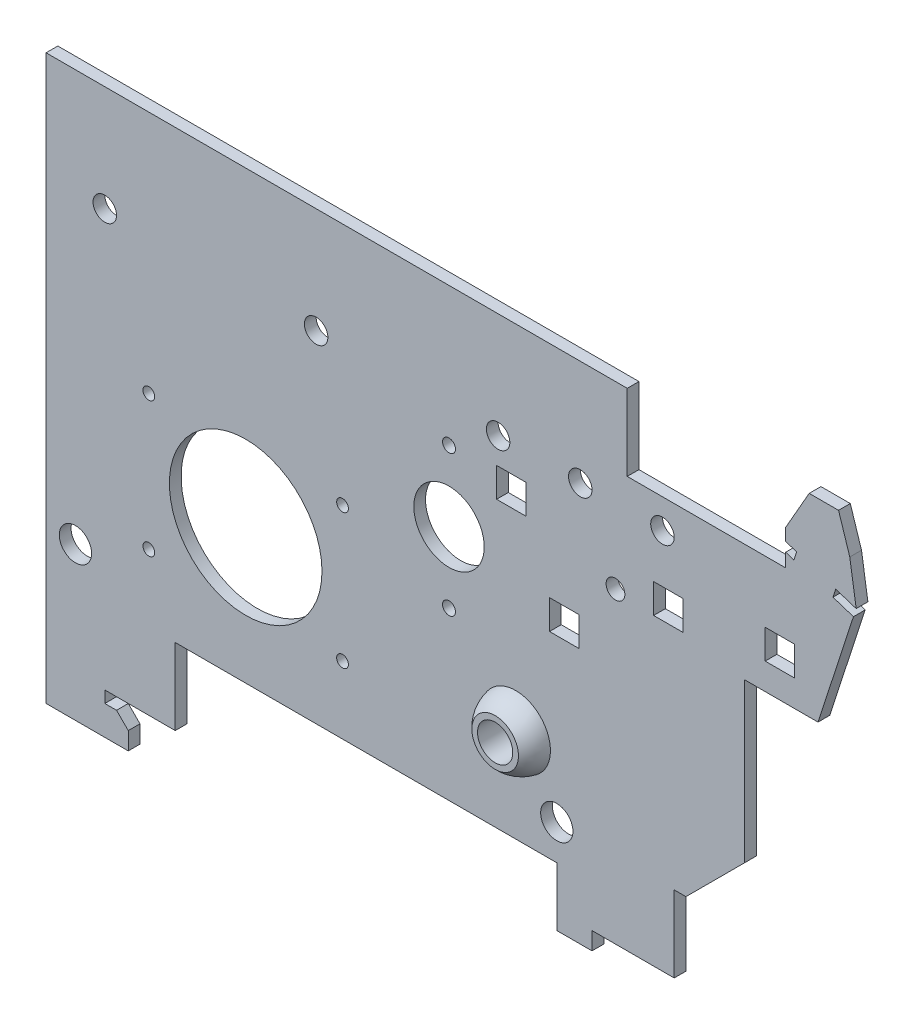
ISO-10303-21;
HEADER;
FILE_DESCRIPTION(('STEP AP214'),'2;1');
FILE_NAME('part.step','',(''),(''),'','','');
FILE_SCHEMA(('AUTOMOTIVE_DESIGN { 1 0 10303 214 1 1 1 1 }'));
ENDSEC;
DATA;
#1=APPLICATION_CONTEXT('core data for automotive mechanical design processes');
#2=APPLICATION_PROTOCOL_DEFINITION('international standard','automotive_design',2000,#1);
#3=PRODUCT_CONTEXT('',#1,'mechanical');
#4=PRODUCT('Part','Part','',(#3));
#5=PRODUCT_RELATED_PRODUCT_CATEGORY('part','',(#4));
#6=PRODUCT_DEFINITION_FORMATION('','',#4);
#7=PRODUCT_DEFINITION_CONTEXT('part definition',#1,'design');
#8=PRODUCT_DEFINITION('design','',#6,#7);
#9=PRODUCT_DEFINITION_SHAPE('','',#8);
#10=(LENGTH_UNIT() NAMED_UNIT(*) SI_UNIT(.MILLI.,.METRE.));
#11=(NAMED_UNIT(*) PLANE_ANGLE_UNIT() SI_UNIT($,.RADIAN.));
#12=(NAMED_UNIT(*) SI_UNIT($,.STERADIAN.) SOLID_ANGLE_UNIT());
#13=UNCERTAINTY_MEASURE_WITH_UNIT(LENGTH_MEASURE(1.E-05),#10,'distance_accuracy_value','');
#14=(GEOMETRIC_REPRESENTATION_CONTEXT(3) GLOBAL_UNCERTAINTY_ASSIGNED_CONTEXT((#13)) GLOBAL_UNIT_ASSIGNED_CONTEXT((#10,
#11,#12)) REPRESENTATION_CONTEXT('',''));
#15=CARTESIAN_POINT('',(0.,0.,0.));
#16=DIRECTION('',(0.,0.,1.));
#17=DIRECTION('',(1.,0.,0.));
#18=AXIS2_PLACEMENT_3D('',#15,#16,#17);
#19=CARTESIAN_POINT('',(46.,47.,1.));
#20=DIRECTION('',(1.,0.,0.));
#21=DIRECTION('',(0.,1.,0.));
#22=AXIS2_PLACEMENT_3D('',#19,#20,#21);
#23=PLANE('',#22);
#24=DIRECTION('',(0.,-1.,0.));
#25=VECTOR('',#24,1.);
#26=CARTESIAN_POINT('',(46.,47.,1.));
#27=LINE('',#26,#25);
#28=CARTESIAN_POINT('',(46.,49.322769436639,1.));
#29=VERTEX_POINT('',#28);
#30=CARTESIAN_POINT('',(46.,47.,1.));
#31=VERTEX_POINT('',#30);
#32=EDGE_CURVE('E627',#29,#31,#27,.T.);
#33=ORIENTED_EDGE('',*,*,#32,.F.);
#34=DIRECTION('',(0.,0.,-1.));
#35=VECTOR('',#34,1.);
#36=CARTESIAN_POINT('',(46.,49.322769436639,1.));
#37=LINE('',#36,#35);
#38=CARTESIAN_POINT('',(46.,49.322769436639,-1.));
#39=VERTEX_POINT('',#38);
#40=EDGE_CURVE('E734',#29,#39,#37,.T.);
#41=ORIENTED_EDGE('',*,*,#40,.T.);
#42=DIRECTION('',(0.,-1.,0.));
#43=VECTOR('',#42,1.);
#44=CARTESIAN_POINT('',(46.,47.,-1.));
#45=LINE('',#44,#43);
#46=CARTESIAN_POINT('',(46.,47.,-1.));
#47=VERTEX_POINT('',#46);
#48=EDGE_CURVE('E572',#39,#47,#45,.T.);
#49=ORIENTED_EDGE('',*,*,#48,.T.);
#50=DIRECTION('',(0.,0.,-1.));
#51=VECTOR('',#50,1.);
#52=CARTESIAN_POINT('',(46.,47.,1.));
#53=LINE('',#52,#51);
#54=EDGE_CURVE('E691',#31,#47,#53,.T.);
#55=ORIENTED_EDGE('',*,*,#54,.F.);
#56=EDGE_LOOP('',(#33,#41,#49,#55));
#57=FACE_BOUND('',#56,.T.);
#58=ADVANCED_FACE('F32',(#57),#23,.F.);
#59=CARTESIAN_POINT('',(7.,-16.,1.));
#60=DIRECTION('',(0.,0.,-1.));
#61=DIRECTION('',(-1.,0.,0.));
#62=AXIS2_PLACEMENT_3D('',#59,#60,#61);
#63=PLANE('',#62);
#64=CARTESIAN_POINT('',(25.,42.,1.));
#65=DIRECTION('',(0.,0.,1.));
#66=DIRECTION('',(1.,0.,0.));
#67=AXIS2_PLACEMENT_3D('',#64,#65,#66);
#68=CIRCLE('',#67,2.);
#69=CARTESIAN_POINT('',(27.,42.,1.));
#70=VERTEX_POINT('',#69);
#71=EDGE_CURVE('E814',#70,#70,#68,.T.);
#72=ORIENTED_EDGE('',*,*,#71,.F.);
#73=EDGE_LOOP('',(#72));
#74=FACE_BOUND('',#73,.T.);
#75=CARTESIAN_POINT('',(11.,42.,1.));
#76=DIRECTION('',(0.,0.,1.));
#77=DIRECTION('',(1.,0.,0.));
#78=AXIS2_PLACEMENT_3D('',#75,#76,#77);
#79=CIRCLE('',#78,2.);
#80=CARTESIAN_POINT('',(13.,42.,1.));
#81=VERTEX_POINT('',#80);
#82=EDGE_CURVE('E810',#81,#81,#79,.T.);
#83=ORIENTED_EDGE('',*,*,#82,.F.);
#84=EDGE_LOOP('',(#83));
#85=FACE_BOUND('',#84,.T.);
#86=CARTESIAN_POINT('',(-2.99999999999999,42.,1.));
#87=DIRECTION('',(0.,0.,1.));
#88=DIRECTION('',(1.,0.,0.));
#89=AXIS2_PLACEMENT_3D('',#86,#87,#88);
#90=CIRCLE('',#89,2.);
#91=CARTESIAN_POINT('',(-0.999999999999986,42.,1.));
#92=VERTEX_POINT('',#91);
#93=EDGE_CURVE('E806',#92,#92,#90,.T.);
#94=ORIENTED_EDGE('',*,*,#93,.F.);
#95=EDGE_LOOP('',(#94));
#96=FACE_BOUND('',#95,.T.);
#97=CARTESIAN_POINT('',(-34.,42.,1.));
#98=DIRECTION('',(0.,0.,1.));
#99=DIRECTION('',(1.,0.,0.));
#100=AXIS2_PLACEMENT_3D('',#97,#98,#99);
#101=CIRCLE('',#100,2.);
#102=CARTESIAN_POINT('',(-32.,42.,1.));
#103=VERTEX_POINT('',#102);
#104=EDGE_CURVE('E802',#103,#103,#101,.T.);
#105=ORIENTED_EDGE('',*,*,#104,.F.);
#106=EDGE_LOOP('',(#105));
#107=FACE_BOUND('',#106,.T.);
#108=CARTESIAN_POINT('',(-70.,42.,1.));
#109=DIRECTION('',(0.,0.,1.));
#110=DIRECTION('',(1.,0.,0.));
#111=AXIS2_PLACEMENT_3D('',#108,#109,#110);
#112=CIRCLE('',#111,2.);
#113=CARTESIAN_POINT('',(-68.,42.,1.));
#114=VERTEX_POINT('',#113);
#115=EDGE_CURVE('E798',#114,#114,#112,.T.);
#116=ORIENTED_EDGE('',*,*,#115,.F.);
#117=EDGE_LOOP('',(#116));
#118=FACE_BOUND('',#117,.T.);
#119=CARTESIAN_POINT('',(-11.3617746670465,12.3933982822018,1.));
#120=DIRECTION('',(0.,0.,1.));
#121=DIRECTION('',(1.,0.,0.));
#122=AXIS2_PLACEMENT_3D('',#119,#120,#121);
#123=CIRCLE('',#122,1.1);
#124=CARTESIAN_POINT('',(-10.2617746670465,12.3933982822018,1.));
#125=VERTEX_POINT('',#124);
#126=EDGE_CURVE('E794',#125,#125,#123,.T.);
#127=ORIENTED_EDGE('',*,*,#126,.F.);
#128=EDGE_LOOP('',(#127));
#129=FACE_BOUND('',#128,.T.);
#130=CARTESIAN_POINT('',(-11.3617746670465,36.3933982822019,1.));
#131=DIRECTION('',(0.,0.,1.));
#132=DIRECTION('',(1.,0.,0.));
#133=AXIS2_PLACEMENT_3D('',#130,#131,#132);
#134=CIRCLE('',#133,1.1);
#135=CARTESIAN_POINT('',(-10.2617746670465,36.3933982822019,1.));
#136=VERTEX_POINT('',#135);
#137=EDGE_CURVE('E790',#136,#136,#134,.T.);
#138=ORIENTED_EDGE('',*,*,#137,.F.);
#139=EDGE_LOOP('',(#138));
#140=FACE_BOUND('',#139,.T.);
#141=CARTESIAN_POINT('',(-11.3617746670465,24.3933982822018,1.));
#142=DIRECTION('',(0.,0.,1.));
#143=DIRECTION('',(1.,0.,0.));
#144=AXIS2_PLACEMENT_3D('',#141,#142,#143);
#145=CIRCLE('',#144,5.99999999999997);
#146=CARTESIAN_POINT('',(-5.36177466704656,24.3933982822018,1.));
#147=VERTEX_POINT('',#146);
#148=EDGE_CURVE('E786',#147,#147,#145,.T.);
#149=ORIENTED_EDGE('',*,*,#148,.F.);
#150=EDGE_LOOP('',(#149));
#151=FACE_BOUND('',#150,.T.);
#152=DIRECTION('',(1.,0.,0.));
#153=VECTOR('',#152,1.);
#154=CARTESIAN_POINT('',(-3.25517294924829,32.5,1.));
#155=LINE('',#154,#153);
#156=CARTESIAN_POINT('',(-3.25517294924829,32.5,1.));
#157=VERTEX_POINT('',#156);
#158=CARTESIAN_POINT('',(1.74482705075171,32.5,1.));
#159=VERTEX_POINT('',#158);
#160=EDGE_CURVE('E365',#157,#159,#155,.T.);
#161=ORIENTED_EDGE('',*,*,#160,.F.);
#162=DIRECTION('',(0.,-1.,0.));
#163=VECTOR('',#162,1.);
#164=CARTESIAN_POINT('',(-3.25517294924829,37.5,1.));
#165=LINE('',#164,#163);
#166=CARTESIAN_POINT('',(-3.25517294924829,37.5,1.));
#167=VERTEX_POINT('',#166);
#168=EDGE_CURVE('E370',#167,#157,#165,.T.);
#169=ORIENTED_EDGE('',*,*,#168,.F.);
#170=DIRECTION('',(-1.,0.,0.));
#171=VECTOR('',#170,1.);
#172=CARTESIAN_POINT('',(-3.25517294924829,37.5,1.));
#173=LINE('',#172,#171);
#174=CARTESIAN_POINT('',(1.74482705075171,37.5,1.));
#175=VERTEX_POINT('',#174);
#176=EDGE_CURVE('E375',#175,#167,#173,.T.);
#177=ORIENTED_EDGE('',*,*,#176,.F.);
#178=DIRECTION('',(0.,1.,0.));
#179=VECTOR('',#178,1.);
#180=CARTESIAN_POINT('',(1.74482705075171,37.5,1.));
#181=LINE('',#180,#179);
#182=EDGE_CURVE('E354',#159,#175,#181,.T.);
#183=ORIENTED_EDGE('',*,*,#182,.F.);
#184=EDGE_LOOP('',(#161,#169,#177,#183));
#185=FACE_BOUND('',#184,.T.);
#186=DIRECTION('',(1.,0.,0.));
#187=VECTOR('',#186,1.);
#188=CARTESIAN_POINT('',(5.75870523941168,17.5,1.));
#189=LINE('',#188,#187);
#190=CARTESIAN_POINT('',(5.75870523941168,17.5,1.));
#191=VERTEX_POINT('',#190);
#192=CARTESIAN_POINT('',(10.7587052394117,17.5,1.));
#193=VERTEX_POINT('',#192);
#194=EDGE_CURVE('E386',#191,#193,#189,.T.);
#195=ORIENTED_EDGE('',*,*,#194,.F.);
#196=DIRECTION('',(0.,-1.,0.));
#197=VECTOR('',#196,1.);
#198=CARTESIAN_POINT('',(5.75870523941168,22.5,1.));
#199=LINE('',#198,#197);
#200=CARTESIAN_POINT('',(5.75870523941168,22.5,1.));
#201=VERTEX_POINT('',#200);
#202=EDGE_CURVE('E382',#201,#191,#199,.T.);
#203=ORIENTED_EDGE('',*,*,#202,.F.);
#204=DIRECTION('',(-1.,0.,0.));
#205=VECTOR('',#204,1.);
#206=CARTESIAN_POINT('',(5.75870523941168,22.5,1.));
#207=LINE('',#206,#205);
#208=CARTESIAN_POINT('',(10.7587052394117,22.5,1.));
#209=VERTEX_POINT('',#208);
#210=EDGE_CURVE('E392',#209,#201,#207,.T.);
#211=ORIENTED_EDGE('',*,*,#210,.F.);
#212=DIRECTION('',(0.,1.,0.));
#213=VECTOR('',#212,1.);
#214=CARTESIAN_POINT('',(10.7587052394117,22.5,1.));
#215=LINE('',#214,#213);
#216=EDGE_CURVE('E389',#193,#209,#215,.T.);
#217=ORIENTED_EDGE('',*,*,#216,.F.);
#218=EDGE_LOOP('',(#195,#203,#211,#217));
#219=FACE_BOUND('',#218,.T.);
#220=DIRECTION('',(1.,0.,0.));
#221=VECTOR('',#220,1.);
#222=CARTESIAN_POINT('',(23.5,28.7359450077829,1.));
#223=LINE('',#222,#221);
#224=CARTESIAN_POINT('',(23.5,28.7359450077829,1.));
#225=VERTEX_POINT('',#224);
#226=CARTESIAN_POINT('',(28.5,28.7359450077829,1.));
#227=VERTEX_POINT('',#226);
#228=EDGE_CURVE('E406',#225,#227,#223,.T.);
#229=ORIENTED_EDGE('',*,*,#228,.F.);
#230=DIRECTION('',(0.,-1.,0.));
#231=VECTOR('',#230,1.);
#232=CARTESIAN_POINT('',(23.5,33.7359450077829,1.));
#233=LINE('',#232,#231);
#234=CARTESIAN_POINT('',(23.5,33.7359450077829,1.));
#235=VERTEX_POINT('',#234);
#236=EDGE_CURVE('E398',#235,#225,#233,.T.);
#237=ORIENTED_EDGE('',*,*,#236,.F.);
#238=DIRECTION('',(-1.,0.,0.));
#239=VECTOR('',#238,1.);
#240=CARTESIAN_POINT('',(23.5,33.7359450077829,1.));
#241=LINE('',#240,#239);
#242=CARTESIAN_POINT('',(28.5,33.7359450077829,1.));
#243=VERTEX_POINT('',#242);
#244=EDGE_CURVE('E412',#243,#235,#241,.T.);
#245=ORIENTED_EDGE('',*,*,#244,.F.);
#246=DIRECTION('',(0.,1.,0.));
#247=VECTOR('',#246,1.);
#248=CARTESIAN_POINT('',(28.5,33.7359450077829,1.));
#249=LINE('',#248,#247);
#250=EDGE_CURVE('E409',#227,#243,#249,.T.);
#251=ORIENTED_EDGE('',*,*,#250,.F.);
#252=EDGE_LOOP('',(#229,#237,#245,#251));
#253=FACE_BOUND('',#252,.T.);
#254=DIRECTION('',(1.,0.,0.));
#255=VECTOR('',#254,1.);
#256=CARTESIAN_POINT('',(42.5,31.5,1.));
#257=LINE('',#256,#255);
#258=CARTESIAN_POINT('',(42.5,31.5,1.));
#259=VERTEX_POINT('',#258);
#260=CARTESIAN_POINT('',(47.5,31.5,1.));
#261=VERTEX_POINT('',#260);
#262=EDGE_CURVE('E426',#259,#261,#257,.T.);
#263=ORIENTED_EDGE('',*,*,#262,.F.);
#264=DIRECTION('',(0.,-1.,0.));
#265=VECTOR('',#264,1.);
#266=CARTESIAN_POINT('',(42.5,36.5,1.));
#267=LINE('',#266,#265);
#268=CARTESIAN_POINT('',(42.5,36.5,1.));
#269=VERTEX_POINT('',#268);
#270=EDGE_CURVE('E418',#269,#259,#267,.T.);
#271=ORIENTED_EDGE('',*,*,#270,.F.);
#272=DIRECTION('',(-1.,0.,0.));
#273=VECTOR('',#272,1.);
#274=CARTESIAN_POINT('',(42.5,36.5,1.));
#275=LINE('',#274,#273);
#276=CARTESIAN_POINT('',(47.5,36.5,1.));
#277=VERTEX_POINT('',#276);
#278=EDGE_CURVE('E432',#277,#269,#275,.T.);
#279=ORIENTED_EDGE('',*,*,#278,.F.);
#280=DIRECTION('',(0.,1.,0.));
#281=VECTOR('',#280,1.);
#282=CARTESIAN_POINT('',(47.5,36.5,1.));
#283=LINE('',#282,#281);
#284=EDGE_CURVE('E429',#261,#277,#283,.T.);
#285=ORIENTED_EDGE('',*,*,#284,.F.);
#286=EDGE_LOOP('',(#263,#271,#279,#285));
#287=FACE_BOUND('',#286,.T.);
#288=CARTESIAN_POINT('',(-29.5,-4.5,1.));
#289=DIRECTION('',(0.,0.,-1.));
#290=DIRECTION('',(-1.,0.,0.));
#291=AXIS2_PLACEMENT_3D('',#288,#289,#290);
#292=CIRCLE('',#291,1.);
#293=CARTESIAN_POINT('',(-30.5,-4.5,1.));
#294=VERTEX_POINT('',#293);
#295=EDGE_CURVE('E447',#294,#294,#292,.T.);
#296=ORIENTED_EDGE('',*,*,#295,.T.);
#297=EDGE_LOOP('',(#296));
#298=FACE_BOUND('',#297,.T.);
#299=CARTESIAN_POINT('',(-62.5,-4.5,1.));
#300=DIRECTION('',(0.,0.,-1.));
#301=DIRECTION('',(-1.,0.,0.));
#302=AXIS2_PLACEMENT_3D('',#299,#300,#301);
#303=CIRCLE('',#302,1.);
#304=CARTESIAN_POINT('',(-63.5,-4.5,1.));
#305=VERTEX_POINT('',#304);
#306=EDGE_CURVE('E453',#305,#305,#303,.T.);
#307=ORIENTED_EDGE('',*,*,#306,.T.);
#308=EDGE_LOOP('',(#307));
#309=FACE_BOUND('',#308,.T.);
#310=CARTESIAN_POINT('',(-62.5,18.5,1.));
#311=DIRECTION('',(0.,0.,-1.));
#312=DIRECTION('',(-1.,0.,0.));
#313=AXIS2_PLACEMENT_3D('',#310,#311,#312);
#314=CIRCLE('',#313,1.00000000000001);
#315=CARTESIAN_POINT('',(-63.5,18.5,1.));
#316=VERTEX_POINT('',#315);
#317=EDGE_CURVE('E459',#316,#316,#314,.T.);
#318=ORIENTED_EDGE('',*,*,#317,.T.);
#319=EDGE_LOOP('',(#318));
#320=FACE_BOUND('',#319,.T.);
#321=CARTESIAN_POINT('',(-29.5,18.5,1.));
#322=DIRECTION('',(0.,0.,-1.));
#323=DIRECTION('',(-1.,0.,0.));
#324=AXIS2_PLACEMENT_3D('',#321,#322,#323);
#325=CIRCLE('',#324,1.);
#326=CARTESIAN_POINT('',(-30.5,18.5,1.));
#327=VERTEX_POINT('',#326);
#328=EDGE_CURVE('E465',#327,#327,#325,.T.);
#329=ORIENTED_EDGE('',*,*,#328,.T.);
#330=EDGE_LOOP('',(#329));
#331=FACE_BOUND('',#330,.T.);
#332=CARTESIAN_POINT('',(17.,29.37,1.));
#333=DIRECTION('',(0.,0.,1.));
#334=DIRECTION('',(1.,0.,0.));
#335=AXIS2_PLACEMENT_3D('',#332,#333,#334);
#336=CIRCLE('',#335,1.6);
#337=CARTESIAN_POINT('',(18.6,29.37,1.));
#338=VERTEX_POINT('',#337);
#339=EDGE_CURVE('E468',#338,#338,#336,.T.);
#340=ORIENTED_EDGE('',*,*,#339,.F.);
#341=EDGE_LOOP('',(#340));
#342=FACE_BOUND('',#341,.T.);
#343=DIRECTION('',(-0.152057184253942,0.988371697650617,0.));
#344=VECTOR('',#343,1.);
#345=CARTESIAN_POINT('',(56.,60.,1.));
#346=LINE('',#345,#344);
#347=CARTESIAN_POINT('',(58.,47.,1.));
#348=VERTEX_POINT('',#347);
#349=CARTESIAN_POINT('',(56.9123431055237,54.0697698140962,1.));
#350=VERTEX_POINT('',#349);
#351=EDGE_CURVE('E621',#348,#350,#346,.T.);
#352=ORIENTED_EDGE('',*,*,#351,.T.);
#353=DIRECTION('',(0.306910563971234,-0.951738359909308,0.));
#354=VECTOR('',#353,1.);
#355=CARTESIAN_POINT('',(55.,60.,1.));
#356=LINE('',#355,#354);
#357=CARTESIAN_POINT('',(55.,60.,1.));
#358=VERTEX_POINT('',#357);
#359=EDGE_CURVE('E11',#350,#358,#356,.F.);
#360=ORIENTED_EDGE('',*,*,#359,.T.);
#361=DIRECTION('',(-1.,0.,0.));
#362=VECTOR('',#361,1.);
#363=CARTESIAN_POINT('',(50.,60.,1.));
#364=LINE('',#363,#362);
#365=CARTESIAN_POINT('',(50.,60.,1.));
#366=VERTEX_POINT('',#365);
#367=EDGE_CURVE('E623',#358,#366,#364,.T.);
#368=ORIENTED_EDGE('',*,*,#367,.T.);
#369=DIRECTION('',(-0.496138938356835,-0.868243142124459,0.));
#370=VECTOR('',#369,1.);
#371=CARTESIAN_POINT('',(46.,53.,1.));
#372=LINE('',#371,#370);
#373=CARTESIAN_POINT('',(46.,53.,1.));
#374=VERTEX_POINT('',#373);
#375=EDGE_CURVE('E625',#366,#374,#372,.T.);
#376=ORIENTED_EDGE('',*,*,#375,.T.);
#377=CARTESIAN_POINT('',(46.,50.9,1.));
#378=VERTEX_POINT('',#377);
#379=EDGE_CURVE('E628',#374,#378,#27,.T.);
#380=ORIENTED_EDGE('',*,*,#379,.T.);
#381=DIRECTION('',(0.951034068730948,-0.309086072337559,0.));
#382=VECTOR('',#381,1.);
#383=CARTESIAN_POINT('',(30.3911814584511,55.9728660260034,1.));
#384=LINE('',#383,#382);
#385=CARTESIAN_POINT('',(47.858550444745,50.2959711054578,1.));
#386=VERTEX_POINT('',#385);
#387=EDGE_CURVE('E506',#378,#386,#384,.T.);
#388=ORIENTED_EDGE('',*,*,#387,.T.);
#389=DIRECTION('',(-0.30908607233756,-0.951034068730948,0.));
#390=VECTOR('',#389,1.);
#391=CARTESIAN_POINT('',(24.4673689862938,-21.6768949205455,1.));
#392=LINE('',#391,#390);
#393=CARTESIAN_POINT('',(47.3949213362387,48.8694200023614,1.));
#394=VERTEX_POINT('',#393);
#395=EDGE_CURVE('E513',#386,#394,#392,.T.);
#396=ORIENTED_EDGE('',*,*,#395,.T.);
#397=DIRECTION('',(-0.951034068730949,0.309086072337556,0.));
#398=VECTOR('',#397,1.);
#399=CARTESIAN_POINT('',(29.9275523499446,54.546314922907,1.));
#400=LINE('',#399,#398);
#401=EDGE_CURVE('E510',#394,#29,#400,.T.);
#402=ORIENTED_EDGE('',*,*,#401,.T.);
#403=ORIENTED_EDGE('',*,*,#32,.T.);
#404=DIRECTION('',(-1.,0.,0.));
#405=VECTOR('',#404,1.);
#406=CARTESIAN_POINT('',(19.,47.,1.));
#407=LINE('',#406,#405);
#408=CARTESIAN_POINT('',(19.,47.,1.));
#409=VERTEX_POINT('',#408);
#410=EDGE_CURVE('E631',#31,#409,#407,.T.);
#411=ORIENTED_EDGE('',*,*,#410,.T.);
#412=DIRECTION('',(0.,1.,0.));
#413=VECTOR('',#412,1.);
#414=CARTESIAN_POINT('',(19.,60.,1.));
#415=LINE('',#414,#413);
#416=CARTESIAN_POINT('',(19.,60.,1.));
#417=VERTEX_POINT('',#416);
#418=EDGE_CURVE('E633',#409,#417,#415,.T.);
#419=ORIENTED_EDGE('',*,*,#418,.T.);
#420=DIRECTION('',(-1.,0.,0.));
#421=VECTOR('',#420,1.);
#422=CARTESIAN_POINT('',(-80.,60.,1.));
#423=LINE('',#422,#421);
#424=CARTESIAN_POINT('',(-80.,60.,1.));
#425=VERTEX_POINT('',#424);
#426=EDGE_CURVE('E635',#417,#425,#423,.T.);
#427=ORIENTED_EDGE('',*,*,#426,.T.);
#428=DIRECTION('',(0.,-1.,0.));
#429=VECTOR('',#428,1.);
#430=CARTESIAN_POINT('',(-80.,-36.,1.));
#431=LINE('',#430,#429);
#432=CARTESIAN_POINT('',(-80.,-36.,1.));
#433=VERTEX_POINT('',#432);
#434=EDGE_CURVE('E637',#425,#433,#431,.T.);
#435=ORIENTED_EDGE('',*,*,#434,.T.);
#436=DIRECTION('',(1.,0.,0.));
#437=VECTOR('',#436,1.);
#438=CARTESIAN_POINT('',(-66.,-36.,1.));
#439=LINE('',#438,#437);
#440=CARTESIAN_POINT('',(-66.,-36.,1.));
#441=VERTEX_POINT('',#440);
#442=EDGE_CURVE('E639',#433,#441,#439,.T.);
#443=ORIENTED_EDGE('',*,*,#442,.T.);
#444=DIRECTION('',(0.,1.,0.));
#445=VECTOR('',#444,1.);
#446=CARTESIAN_POINT('',(-66.,-33.,1.));
#447=LINE('',#446,#445);
#448=CARTESIAN_POINT('',(-66.,-33.,1.));
#449=VERTEX_POINT('',#448);
#450=EDGE_CURVE('E641',#441,#449,#447,.T.);
#451=ORIENTED_EDGE('',*,*,#450,.T.);
#452=DIRECTION('',(-0.707106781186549,0.707106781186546,0.));
#453=VECTOR('',#452,1.);
#454=CARTESIAN_POINT('',(-68.,-31.,1.));
#455=LINE('',#454,#453);
#456=CARTESIAN_POINT('',(-68.,-31.,1.));
#457=VERTEX_POINT('',#456);
#458=EDGE_CURVE('E643',#449,#457,#455,.T.);
#459=ORIENTED_EDGE('',*,*,#458,.T.);
#460=DIRECTION('',(-1.,0.,0.));
#461=VECTOR('',#460,1.);
#462=CARTESIAN_POINT('',(-70.,-31.,1.));
#463=LINE('',#462,#461);
#464=CARTESIAN_POINT('',(-70.,-31.,1.));
#465=VERTEX_POINT('',#464);
#466=EDGE_CURVE('E645',#457,#465,#463,.T.);
#467=ORIENTED_EDGE('',*,*,#466,.T.);
#468=DIRECTION('',(0.,1.,0.));
#469=VECTOR('',#468,1.);
#470=CARTESIAN_POINT('',(-70.,-29.,1.));
#471=LINE('',#470,#469);
#472=CARTESIAN_POINT('',(-70.,-29.,1.));
#473=VERTEX_POINT('',#472);
#474=EDGE_CURVE('E647',#465,#473,#471,.T.);
#475=ORIENTED_EDGE('',*,*,#474,.T.);
#476=DIRECTION('',(1.,0.,0.));
#477=VECTOR('',#476,1.);
#478=CARTESIAN_POINT('',(-58.,-29.,1.));
#479=LINE('',#478,#477);
#480=CARTESIAN_POINT('',(-58.,-29.,1.));
#481=VERTEX_POINT('',#480);
#482=EDGE_CURVE('E649',#473,#481,#479,.T.);
#483=ORIENTED_EDGE('',*,*,#482,.T.);
#484=DIRECTION('',(0.,1.,0.));
#485=VECTOR('',#484,1.);
#486=CARTESIAN_POINT('',(-58.,-16.,1.));
#487=LINE('',#486,#485);
#488=CARTESIAN_POINT('',(-58.,-16.,1.));
#489=VERTEX_POINT('',#488);
#490=EDGE_CURVE('E651',#481,#489,#487,.T.);
#491=ORIENTED_EDGE('',*,*,#490,.T.);
#492=DIRECTION('',(1.,0.,0.));
#493=VECTOR('',#492,1.);
#494=CARTESIAN_POINT('',(7.,-16.,1.));
#495=LINE('',#494,#493);
#496=CARTESIAN_POINT('',(7.,-16.,1.));
#497=VERTEX_POINT('',#496);
#498=EDGE_CURVE('E653',#489,#497,#495,.T.);
#499=ORIENTED_EDGE('',*,*,#498,.T.);
#500=DIRECTION('',(0.,-1.,0.));
#501=VECTOR('',#500,1.);
#502=CARTESIAN_POINT('',(7.,-16.,1.));
#503=LINE('',#502,#501);
#504=CARTESIAN_POINT('',(7.,-26.,1.));
#505=VERTEX_POINT('',#504);
#506=EDGE_CURVE('E600',#497,#505,#503,.T.);
#507=ORIENTED_EDGE('',*,*,#506,.T.);
#508=DIRECTION('',(1.,0.,0.));
#509=VECTOR('',#508,1.);
#510=CARTESIAN_POINT('',(7.,-26.,1.));
#511=LINE('',#510,#509);
#512=CARTESIAN_POINT('',(13.,-26.,1.));
#513=VERTEX_POINT('',#512);
#514=EDGE_CURVE('E603',#505,#513,#511,.T.);
#515=ORIENTED_EDGE('',*,*,#514,.T.);
#516=DIRECTION('',(0.,1.,0.));
#517=VECTOR('',#516,1.);
#518=CARTESIAN_POINT('',(13.,-26.,1.));
#519=LINE('',#518,#517);
#520=CARTESIAN_POINT('',(13.,-23.,1.));
#521=VERTEX_POINT('',#520);
#522=EDGE_CURVE('E605',#513,#521,#519,.T.);
#523=ORIENTED_EDGE('',*,*,#522,.T.);
#524=DIRECTION('',(1.,0.,0.));
#525=VECTOR('',#524,1.);
#526=CARTESIAN_POINT('',(13.,-23.,1.));
#527=LINE('',#526,#525);
#528=CARTESIAN_POINT('',(27.,-23.,1.));
#529=VERTEX_POINT('',#528);
#530=EDGE_CURVE('E607',#521,#529,#527,.T.);
#531=ORIENTED_EDGE('',*,*,#530,.T.);
#532=DIRECTION('',(0.,1.,0.));
#533=VECTOR('',#532,1.);
#534=CARTESIAN_POINT('',(27.,-10.,1.));
#535=LINE('',#534,#533);
#536=CARTESIAN_POINT('',(27.,-10.,1.));
#537=VERTEX_POINT('',#536);
#538=EDGE_CURVE('E609',#529,#537,#535,.T.);
#539=ORIENTED_EDGE('',*,*,#538,.T.);
#540=DIRECTION('',(1.,0.,0.));
#541=VECTOR('',#540,1.);
#542=CARTESIAN_POINT('',(39.,-10.,1.));
#543=LINE('',#542,#541);
#544=CARTESIAN_POINT('',(29.,-10.,1.));
#545=VERTEX_POINT('',#544);
#546=EDGE_CURVE('E611',#537,#545,#543,.T.);
#547=ORIENTED_EDGE('',*,*,#546,.T.);
#548=DIRECTION('',(-0.707106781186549,-0.707106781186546,0.));
#549=VECTOR('',#548,1.);
#550=CARTESIAN_POINT('',(39.,0.,1.));
#551=LINE('',#550,#549);
#552=CARTESIAN_POINT('',(39.,0.,1.));
#553=VERTEX_POINT('',#552);
#554=EDGE_CURVE('E744',#545,#553,#551,.F.);
#555=ORIENTED_EDGE('',*,*,#554,.T.);
#556=DIRECTION('',(0.,1.,0.));
#557=VECTOR('',#556,1.);
#558=CARTESIAN_POINT('',(39.,-10.,1.));
#559=LINE('',#558,#557);
#560=CARTESIAN_POINT('',(39.,27.,1.));
#561=VERTEX_POINT('',#560);
#562=EDGE_CURVE('E614',#553,#561,#559,.T.);
#563=ORIENTED_EDGE('',*,*,#562,.T.);
#564=DIRECTION('',(1.,0.,0.));
#565=VECTOR('',#564,1.);
#566=CARTESIAN_POINT('',(39.,27.,1.));
#567=LINE('',#566,#565);
#568=CARTESIAN_POINT('',(51.5,27.,1.));
#569=VERTEX_POINT('',#568);
#570=EDGE_CURVE('E616',#561,#569,#567,.T.);
#571=ORIENTED_EDGE('',*,*,#570,.T.);
#572=DIRECTION('',(0.309086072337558,0.951034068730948,0.));
#573=VECTOR('',#572,1.);
#574=CARTESIAN_POINT('',(51.5,27.,1.));
#575=LINE('',#574,#573);
#576=CARTESIAN_POINT('',(57.5363708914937,45.5734488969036,1.));
#577=VERTEX_POINT('',#576);
#578=EDGE_CURVE('E618',#569,#577,#575,.T.);
#579=ORIENTED_EDGE('',*,*,#578,.T.);
#580=DIRECTION('',(-0.951034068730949,0.309086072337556,0.));
#581=VECTOR('',#580,1.);
#582=CARTESIAN_POINT('',(29.9275523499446,54.546314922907,1.));
#583=LINE('',#582,#581);
#584=CARTESIAN_POINT('',(54.0521598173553,46.7058174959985,1.));
#585=VERTEX_POINT('',#584);
#586=EDGE_CURVE('E489',#577,#585,#583,.T.);
#587=ORIENTED_EDGE('',*,*,#586,.T.);
#588=DIRECTION('',(0.309086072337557,0.951034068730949,0.));
#589=VECTOR('',#588,1.);
#590=CARTESIAN_POINT('',(31.1246074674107,-23.8404974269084,1.));
#591=LINE('',#590,#589);
#592=CARTESIAN_POINT('',(54.5157889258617,48.1323685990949,1.));
#593=VERTEX_POINT('',#592);
#594=EDGE_CURVE('E492',#585,#593,#591,.T.);
#595=ORIENTED_EDGE('',*,*,#594,.T.);
#596=DIRECTION('',(0.951034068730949,-0.309086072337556,0.));
#597=VECTOR('',#596,1.);
#598=CARTESIAN_POINT('',(30.391181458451,55.9728660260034,1.));
#599=LINE('',#598,#597);
#600=EDGE_CURVE('E483',#593,#348,#599,.T.);
#601=ORIENTED_EDGE('',*,*,#600,.T.);
#602=EDGE_LOOP('',(#352,#360,#368,#376,#380,#388,#396,#402,#403,#411,#419,#427,#435,#443,#451,
#459,#467,#475,#483,#491,#499,#507,#515,#523,#531,#539,#547,#555,#563,#571,#579,#587,#595,#601));
#603=FACE_BOUND('',#602,.T.);
#604=CARTESIAN_POINT('',(0.,0.,1.));
#605=DIRECTION('',(0.,0.,-1.));
#606=DIRECTION('',(-1.,0.,0.));
#607=AXIS2_PLACEMENT_3D('',#604,#605,#606);
#608=CIRCLE('',#607,5.91607978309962);
#609=CARTESIAN_POINT('',(-5.91607978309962,0.,1.));
#610=VERTEX_POINT('',#609);
#611=EDGE_CURVE('E523',#610,#610,#608,.T.);
#612=ORIENTED_EDGE('',*,*,#611,.T.);
#613=EDGE_LOOP('',(#612));
#614=FACE_BOUND('',#613,.T.);
#615=CARTESIAN_POINT('',(-75.,-10.,1.));
#616=DIRECTION('',(0.,0.,1.));
#617=DIRECTION('',(1.,0.,0.));
#618=AXIS2_PLACEMENT_3D('',#615,#616,#617);
#619=CIRCLE('',#618,2.75000000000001);
#620=CARTESIAN_POINT('',(-72.25,-10.,1.));
#621=VERTEX_POINT('',#620);
#622=EDGE_CURVE('E536',#621,#621,#619,.T.);
#623=ORIENTED_EDGE('',*,*,#622,.F.);
#624=EDGE_LOOP('',(#623));
#625=FACE_BOUND('',#624,.T.);
#626=CARTESIAN_POINT('',(7.,-10.,1.));
#627=DIRECTION('',(0.,0.,1.));
#628=DIRECTION('',(1.,0.,0.));
#629=AXIS2_PLACEMENT_3D('',#626,#627,#628);
#630=CIRCLE('',#629,2.75);
#631=CARTESIAN_POINT('',(9.75,-10.,1.));
#632=VERTEX_POINT('',#631);
#633=EDGE_CURVE('E542',#632,#632,#630,.T.);
#634=ORIENTED_EDGE('',*,*,#633,.F.);
#635=EDGE_LOOP('',(#634));
#636=FACE_BOUND('',#635,.T.);
#637=CARTESIAN_POINT('',(-46.,7.,1.));
#638=DIRECTION('',(0.,0.,1.));
#639=DIRECTION('',(1.,0.,0.));
#640=AXIS2_PLACEMENT_3D('',#637,#638,#639);
#641=CIRCLE('',#640,13.);
#642=CARTESIAN_POINT('',(-33.,7.,1.));
#643=VERTEX_POINT('',#642);
#644=EDGE_CURVE('E530',#643,#643,#641,.T.);
#645=ORIENTED_EDGE('',*,*,#644,.F.);
#646=EDGE_LOOP('',(#645));
#647=FACE_BOUND('',#646,.T.);
#648=ADVANCED_FACE('F372',(#74,#85,#96,#107,#118,#129,#140,#151,#185,#219,#253,#287,#298,#309,
#320,#331,#342,#603,#614,#625,#636,#647),#63,.F.);
#649=CARTESIAN_POINT('',(7.,-16.,-1.));
#650=DIRECTION('',(0.,0.,-1.));
#651=DIRECTION('',(-1.,0.,0.));
#652=AXIS2_PLACEMENT_3D('',#649,#650,#651);
#653=PLANE('',#652);
#654=CARTESIAN_POINT('',(25.,42.,-1.));
#655=DIRECTION('',(0.,0.,-1.));
#656=DIRECTION('',(-1.,0.,0.));
#657=AXIS2_PLACEMENT_3D('',#654,#655,#656);
#658=CIRCLE('',#657,2.);
#659=CARTESIAN_POINT('',(23.,42.,-1.));
#660=VERTEX_POINT('',#659);
#661=EDGE_CURVE('E811',#660,#660,#658,.T.);
#662=ORIENTED_EDGE('',*,*,#661,.F.);
#663=EDGE_LOOP('',(#662));
#664=FACE_BOUND('',#663,.T.);
#665=CARTESIAN_POINT('',(11.,42.,-1.));
#666=DIRECTION('',(0.,0.,-1.));
#667=DIRECTION('',(-1.,0.,0.));
#668=AXIS2_PLACEMENT_3D('',#665,#666,#667);
#669=CIRCLE('',#668,2.);
#670=CARTESIAN_POINT('',(9.00000000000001,42.,-1.));
#671=VERTEX_POINT('',#670);
#672=EDGE_CURVE('E807',#671,#671,#669,.T.);
#673=ORIENTED_EDGE('',*,*,#672,.F.);
#674=EDGE_LOOP('',(#673));
#675=FACE_BOUND('',#674,.T.);
#676=CARTESIAN_POINT('',(-2.99999999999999,42.,-1.));
#677=DIRECTION('',(0.,0.,-1.));
#678=DIRECTION('',(-1.,0.,0.));
#679=AXIS2_PLACEMENT_3D('',#676,#677,#678);
#680=CIRCLE('',#679,2.);
#681=CARTESIAN_POINT('',(-4.99999999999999,42.,-1.));
#682=VERTEX_POINT('',#681);
#683=EDGE_CURVE('E803',#682,#682,#680,.T.);
#684=ORIENTED_EDGE('',*,*,#683,.F.);
#685=EDGE_LOOP('',(#684));
#686=FACE_BOUND('',#685,.T.);
#687=CARTESIAN_POINT('',(-34.,42.,-1.));
#688=DIRECTION('',(0.,0.,-1.));
#689=DIRECTION('',(-1.,0.,0.));
#690=AXIS2_PLACEMENT_3D('',#687,#688,#689);
#691=CIRCLE('',#690,2.);
#692=CARTESIAN_POINT('',(-36.,42.,-1.));
#693=VERTEX_POINT('',#692);
#694=EDGE_CURVE('E799',#693,#693,#691,.T.);
#695=ORIENTED_EDGE('',*,*,#694,.F.);
#696=EDGE_LOOP('',(#695));
#697=FACE_BOUND('',#696,.T.);
#698=CARTESIAN_POINT('',(-70.,42.,-1.));
#699=DIRECTION('',(0.,0.,-1.));
#700=DIRECTION('',(-1.,0.,0.));
#701=AXIS2_PLACEMENT_3D('',#698,#699,#700);
#702=CIRCLE('',#701,2.);
#703=CARTESIAN_POINT('',(-72.,42.,-1.));
#704=VERTEX_POINT('',#703);
#705=EDGE_CURVE('E795',#704,#704,#702,.T.);
#706=ORIENTED_EDGE('',*,*,#705,.F.);
#707=EDGE_LOOP('',(#706));
#708=FACE_BOUND('',#707,.T.);
#709=CARTESIAN_POINT('',(-11.3617746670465,12.3933982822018,-1.));
#710=DIRECTION('',(0.,0.,-1.));
#711=DIRECTION('',(-1.,0.,0.));
#712=AXIS2_PLACEMENT_3D('',#709,#710,#711);
#713=CIRCLE('',#712,1.1);
#714=CARTESIAN_POINT('',(-12.4617746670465,12.3933982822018,-1.));
#715=VERTEX_POINT('',#714);
#716=EDGE_CURVE('E791',#715,#715,#713,.T.);
#717=ORIENTED_EDGE('',*,*,#716,.F.);
#718=EDGE_LOOP('',(#717));
#719=FACE_BOUND('',#718,.T.);
#720=CARTESIAN_POINT('',(-11.3617746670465,36.3933982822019,-1.));
#721=DIRECTION('',(0.,0.,-1.));
#722=DIRECTION('',(-1.,0.,0.));
#723=AXIS2_PLACEMENT_3D('',#720,#721,#722);
#724=CIRCLE('',#723,1.1);
#725=CARTESIAN_POINT('',(-12.4617746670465,36.3933982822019,-1.));
#726=VERTEX_POINT('',#725);
#727=EDGE_CURVE('E787',#726,#726,#724,.T.);
#728=ORIENTED_EDGE('',*,*,#727,.F.);
#729=EDGE_LOOP('',(#728));
#730=FACE_BOUND('',#729,.T.);
#731=CARTESIAN_POINT('',(-11.3617746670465,24.3933982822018,-1.));
#732=DIRECTION('',(0.,0.,-1.));
#733=DIRECTION('',(-1.,0.,0.));
#734=AXIS2_PLACEMENT_3D('',#731,#732,#733);
#735=CIRCLE('',#734,5.99999999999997);
#736=CARTESIAN_POINT('',(-17.3617746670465,24.3933982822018,-1.));
#737=VERTEX_POINT('',#736);
#738=EDGE_CURVE('E783',#737,#737,#735,.T.);
#739=ORIENTED_EDGE('',*,*,#738,.F.);
#740=EDGE_LOOP('',(#739));
#741=FACE_BOUND('',#740,.T.);
#742=DIRECTION('',(0.,1.,0.));
#743=VECTOR('',#742,1.);
#744=CARTESIAN_POINT('',(-3.25517294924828,-16.,-1.));
#745=LINE('',#744,#743);
#746=CARTESIAN_POINT('',(-3.25517294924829,32.5,-1.));
#747=VERTEX_POINT('',#746);
#748=CARTESIAN_POINT('',(-3.25517294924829,37.5,-1.));
#749=VERTEX_POINT('',#748);
#750=EDGE_CURVE('E780',#747,#749,#745,.T.);
#751=ORIENTED_EDGE('',*,*,#750,.F.);
#752=DIRECTION('',(-1.,0.,0.));
#753=VECTOR('',#752,1.);
#754=CARTESIAN_POINT('',(7.,32.5,-1.));
#755=LINE('',#754,#753);
#756=CARTESIAN_POINT('',(1.74482705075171,32.5,-1.));
#757=VERTEX_POINT('',#756);
#758=EDGE_CURVE('E775',#757,#747,#755,.T.);
#759=ORIENTED_EDGE('',*,*,#758,.F.);
#760=DIRECTION('',(0.,-1.,0.));
#761=VECTOR('',#760,1.);
#762=CARTESIAN_POINT('',(1.74482705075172,-16.,-1.));
#763=LINE('',#762,#761);
#764=CARTESIAN_POINT('',(1.74482705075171,37.5,-1.));
#765=VERTEX_POINT('',#764);
#766=EDGE_CURVE('E357',#765,#757,#763,.T.);
#767=ORIENTED_EDGE('',*,*,#766,.F.);
#768=DIRECTION('',(1.,0.,0.));
#769=VECTOR('',#768,1.);
#770=CARTESIAN_POINT('',(7.,37.5,-1.));
#771=LINE('',#770,#769);
#772=EDGE_CURVE('E778',#749,#765,#771,.T.);
#773=ORIENTED_EDGE('',*,*,#772,.F.);
#774=EDGE_LOOP('',(#751,#759,#767,#773));
#775=FACE_BOUND('',#774,.T.);
#776=DIRECTION('',(0.,1.,0.));
#777=VECTOR('',#776,1.);
#778=CARTESIAN_POINT('',(5.75870523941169,-16.,-1.));
#779=LINE('',#778,#777);
#780=CARTESIAN_POINT('',(5.75870523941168,17.5,-1.));
#781=VERTEX_POINT('',#780);
#782=CARTESIAN_POINT('',(5.75870523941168,22.5,-1.));
#783=VERTEX_POINT('',#782);
#784=EDGE_CURVE('E773',#781,#783,#779,.T.);
#785=ORIENTED_EDGE('',*,*,#784,.F.);
#786=DIRECTION('',(-1.,0.,0.));
#787=VECTOR('',#786,1.);
#788=CARTESIAN_POINT('',(7.,17.5,-1.));
#789=LINE('',#788,#787);
#790=CARTESIAN_POINT('',(10.7587052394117,17.5,-1.));
#791=VERTEX_POINT('',#790);
#792=EDGE_CURVE('E766',#791,#781,#789,.T.);
#793=ORIENTED_EDGE('',*,*,#792,.F.);
#794=DIRECTION('',(0.,-1.,0.));
#795=VECTOR('',#794,1.);
#796=CARTESIAN_POINT('',(10.7587052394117,-16.,-1.));
#797=LINE('',#796,#795);
#798=CARTESIAN_POINT('',(10.7587052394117,22.5,-1.));
#799=VERTEX_POINT('',#798);
#800=EDGE_CURVE('E768',#799,#791,#797,.T.);
#801=ORIENTED_EDGE('',*,*,#800,.F.);
#802=DIRECTION('',(1.,0.,0.));
#803=VECTOR('',#802,1.);
#804=CARTESIAN_POINT('',(7.,22.5,-1.));
#805=LINE('',#804,#803);
#806=EDGE_CURVE('E771',#783,#799,#805,.T.);
#807=ORIENTED_EDGE('',*,*,#806,.F.);
#808=EDGE_LOOP('',(#785,#793,#801,#807));
#809=FACE_BOUND('',#808,.T.);
#810=DIRECTION('',(0.,1.,0.));
#811=VECTOR('',#810,1.);
#812=CARTESIAN_POINT('',(23.5,-16.,-1.));
#813=LINE('',#812,#811);
#814=CARTESIAN_POINT('',(23.5,28.7359450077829,-1.));
#815=VERTEX_POINT('',#814);
#816=CARTESIAN_POINT('',(23.5,33.7359450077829,-1.));
#817=VERTEX_POINT('',#816);
#818=EDGE_CURVE('E764',#815,#817,#813,.T.);
#819=ORIENTED_EDGE('',*,*,#818,.F.);
#820=DIRECTION('',(-1.,0.,0.));
#821=VECTOR('',#820,1.);
#822=CARTESIAN_POINT('',(7.,28.7359450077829,-1.));
#823=LINE('',#822,#821);
#824=CARTESIAN_POINT('',(28.5,28.7359450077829,-1.));
#825=VERTEX_POINT('',#824);
#826=EDGE_CURVE('E757',#825,#815,#823,.T.);
#827=ORIENTED_EDGE('',*,*,#826,.F.);
#828=DIRECTION('',(0.,-1.,0.));
#829=VECTOR('',#828,1.);
#830=CARTESIAN_POINT('',(28.5,-16.,-1.));
#831=LINE('',#830,#829);
#832=CARTESIAN_POINT('',(28.5,33.7359450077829,-1.));
#833=VERTEX_POINT('',#832);
#834=EDGE_CURVE('E759',#833,#825,#831,.T.);
#835=ORIENTED_EDGE('',*,*,#834,.F.);
#836=DIRECTION('',(1.,0.,0.));
#837=VECTOR('',#836,1.);
#838=CARTESIAN_POINT('',(7.,33.7359450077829,-1.));
#839=LINE('',#838,#837);
#840=EDGE_CURVE('E762',#817,#833,#839,.T.);
#841=ORIENTED_EDGE('',*,*,#840,.F.);
#842=EDGE_LOOP('',(#819,#827,#835,#841));
#843=FACE_BOUND('',#842,.T.);
#844=DIRECTION('',(0.,1.,0.));
#845=VECTOR('',#844,1.);
#846=CARTESIAN_POINT('',(42.4999999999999,-16.,-1.));
#847=LINE('',#846,#845);
#848=CARTESIAN_POINT('',(42.5,31.5,-1.));
#849=VERTEX_POINT('',#848);
#850=CARTESIAN_POINT('',(42.5,36.5,-1.));
#851=VERTEX_POINT('',#850);
#852=EDGE_CURVE('E755',#849,#851,#847,.T.);
#853=ORIENTED_EDGE('',*,*,#852,.F.);
#854=DIRECTION('',(-1.,0.,0.));
#855=VECTOR('',#854,1.);
#856=CARTESIAN_POINT('',(7.,31.5,-1.));
#857=LINE('',#856,#855);
#858=CARTESIAN_POINT('',(47.5,31.5,-1.));
#859=VERTEX_POINT('',#858);
#860=EDGE_CURVE('E746',#859,#849,#857,.T.);
#861=ORIENTED_EDGE('',*,*,#860,.F.);
#862=DIRECTION('',(0.,-1.,0.));
#863=VECTOR('',#862,1.);
#864=CARTESIAN_POINT('',(47.5,-16.,-1.));
#865=LINE('',#864,#863);
#866=CARTESIAN_POINT('',(47.5,36.5,-1.));
#867=VERTEX_POINT('',#866);
#868=EDGE_CURVE('E750',#867,#859,#865,.T.);
#869=ORIENTED_EDGE('',*,*,#868,.F.);
#870=DIRECTION('',(1.,0.,0.));
#871=VECTOR('',#870,1.);
#872=CARTESIAN_POINT('',(7.,36.5,-1.));
#873=LINE('',#872,#871);
#874=EDGE_CURVE('E753',#851,#867,#873,.T.);
#875=ORIENTED_EDGE('',*,*,#874,.F.);
#876=EDGE_LOOP('',(#853,#861,#869,#875));
#877=FACE_BOUND('',#876,.T.);
#878=CARTESIAN_POINT('',(-29.5,-4.5,-1.));
#879=DIRECTION('',(0.,0.,-1.));
#880=DIRECTION('',(-1.,0.,0.));
#881=AXIS2_PLACEMENT_3D('',#878,#879,#880);
#882=CIRCLE('',#881,1.);
#883=CARTESIAN_POINT('',(-30.5,-4.5,-1.));
#884=VERTEX_POINT('',#883);
#885=EDGE_CURVE('E438',#884,#884,#882,.T.);
#886=ORIENTED_EDGE('',*,*,#885,.F.);
#887=EDGE_LOOP('',(#886));
#888=FACE_BOUND('',#887,.T.);
#889=CARTESIAN_POINT('',(-62.5,-4.5,-1.));
#890=DIRECTION('',(0.,0.,-1.));
#891=DIRECTION('',(-1.,0.,0.));
#892=AXIS2_PLACEMENT_3D('',#889,#890,#891);
#893=CIRCLE('',#892,1.);
#894=CARTESIAN_POINT('',(-63.5,-4.5,-1.));
#895=VERTEX_POINT('',#894);
#896=EDGE_CURVE('E450',#895,#895,#893,.T.);
#897=ORIENTED_EDGE('',*,*,#896,.F.);
#898=EDGE_LOOP('',(#897));
#899=FACE_BOUND('',#898,.T.);
#900=CARTESIAN_POINT('',(-62.5,18.5,-1.));
#901=DIRECTION('',(0.,0.,-1.));
#902=DIRECTION('',(-1.,0.,0.));
#903=AXIS2_PLACEMENT_3D('',#900,#901,#902);
#904=CIRCLE('',#903,1.00000000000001);
#905=CARTESIAN_POINT('',(-63.5,18.5,-1.));
#906=VERTEX_POINT('',#905);
#907=EDGE_CURVE('E456',#906,#906,#904,.T.);
#908=ORIENTED_EDGE('',*,*,#907,.F.);
#909=EDGE_LOOP('',(#908));
#910=FACE_BOUND('',#909,.T.);
#911=CARTESIAN_POINT('',(-29.5,18.5,-1.));
#912=DIRECTION('',(0.,0.,-1.));
#913=DIRECTION('',(-1.,0.,0.));
#914=AXIS2_PLACEMENT_3D('',#911,#912,#913);
#915=CIRCLE('',#914,1.);
#916=CARTESIAN_POINT('',(-30.5,18.5,-1.));
#917=VERTEX_POINT('',#916);
#918=EDGE_CURVE('E462',#917,#917,#915,.T.);
#919=ORIENTED_EDGE('',*,*,#918,.F.);
#920=EDGE_LOOP('',(#919));
#921=FACE_BOUND('',#920,.T.);
#922=CARTESIAN_POINT('',(17.,29.37,-1.));
#923=DIRECTION('',(0.,0.,-1.));
#924=DIRECTION('',(-1.,0.,0.));
#925=AXIS2_PLACEMENT_3D('',#922,#923,#924);
#926=CIRCLE('',#925,1.6);
#927=CARTESIAN_POINT('',(15.4,29.37,-1.));
#928=VERTEX_POINT('',#927);
#929=EDGE_CURVE('E471',#928,#928,#926,.T.);
#930=ORIENTED_EDGE('',*,*,#929,.F.);
#931=EDGE_LOOP('',(#930));
#932=FACE_BOUND('',#931,.T.);
#933=DIRECTION('',(-1.,0.,0.));
#934=VECTOR('',#933,1.);
#935=CARTESIAN_POINT('',(50.,60.,-1.));
#936=LINE('',#935,#934);
#937=CARTESIAN_POINT('',(55.,60.,-1.));
#938=VERTEX_POINT('',#937);
#939=CARTESIAN_POINT('',(50.,60.,-1.));
#940=VERTEX_POINT('',#939);
#941=EDGE_CURVE('E568',#938,#940,#936,.T.);
#942=ORIENTED_EDGE('',*,*,#941,.F.);
#943=DIRECTION('',(-0.306910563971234,0.951738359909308,0.));
#944=VECTOR('',#943,1.);
#945=CARTESIAN_POINT('',(72.6781737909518,5.17948189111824,-1.));
#946=LINE('',#945,#944);
#947=CARTESIAN_POINT('',(56.9123431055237,54.0697698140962,-1.));
#948=VERTEX_POINT('',#947);
#949=EDGE_CURVE('E54',#938,#948,#946,.F.);
#950=ORIENTED_EDGE('',*,*,#949,.T.);
#951=DIRECTION('',(-0.152057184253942,0.988371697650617,0.));
#952=VECTOR('',#951,1.);
#953=CARTESIAN_POINT('',(56.,60.,-1.));
#954=LINE('',#953,#952);
#955=CARTESIAN_POINT('',(58.,47.,-1.));
#956=VERTEX_POINT('',#955);
#957=EDGE_CURVE('E566',#956,#948,#954,.T.);
#958=ORIENTED_EDGE('',*,*,#957,.F.);
#959=DIRECTION('',(0.951034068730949,-0.309086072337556,0.));
#960=VECTOR('',#959,1.);
#961=CARTESIAN_POINT('',(58.,47.,-1.));
#962=LINE('',#961,#960);
#963=CARTESIAN_POINT('',(54.5157889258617,48.1323685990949,-1.));
#964=VERTEX_POINT('',#963);
#965=EDGE_CURVE('E478',#964,#956,#962,.T.);
#966=ORIENTED_EDGE('',*,*,#965,.F.);
#967=DIRECTION('',(0.309086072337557,0.951034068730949,0.));
#968=VECTOR('',#967,1.);
#969=CARTESIAN_POINT('',(54.0521598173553,46.7058174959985,-1.));
#970=LINE('',#969,#968);
#971=CARTESIAN_POINT('',(54.0521598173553,46.7058174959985,-1.));
#972=VERTEX_POINT('',#971);
#973=EDGE_CURVE('E475',#972,#964,#970,.T.);
#974=ORIENTED_EDGE('',*,*,#973,.F.);
#975=DIRECTION('',(-0.951034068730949,0.309086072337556,0.));
#976=VECTOR('',#975,1.);
#977=CARTESIAN_POINT('',(57.5363708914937,45.5734488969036,-1.));
#978=LINE('',#977,#976);
#979=CARTESIAN_POINT('',(57.5363708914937,45.5734488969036,-1.));
#980=VERTEX_POINT('',#979);
#981=EDGE_CURVE('E472',#980,#972,#978,.T.);
#982=ORIENTED_EDGE('',*,*,#981,.F.);
#983=DIRECTION('',(0.309086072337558,0.951034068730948,0.));
#984=VECTOR('',#983,1.);
#985=CARTESIAN_POINT('',(51.5,27.,-1.));
#986=LINE('',#985,#984);
#987=CARTESIAN_POINT('',(51.5,27.,-1.));
#988=VERTEX_POINT('',#987);
#989=EDGE_CURVE('E563',#988,#980,#986,.T.);
#990=ORIENTED_EDGE('',*,*,#989,.F.);
#991=DIRECTION('',(1.,0.,0.));
#992=VECTOR('',#991,1.);
#993=CARTESIAN_POINT('',(39.,27.,-1.));
#994=LINE('',#993,#992);
#995=CARTESIAN_POINT('',(39.,27.,-1.));
#996=VERTEX_POINT('',#995);
#997=EDGE_CURVE('E561',#996,#988,#994,.T.);
#998=ORIENTED_EDGE('',*,*,#997,.F.);
#999=DIRECTION('',(0.,1.,0.));
#1000=VECTOR('',#999,1.);
#1001=CARTESIAN_POINT('',(39.,-10.,-1.));
#1002=LINE('',#1001,#1000);
#1003=CARTESIAN_POINT('',(39.,0.,-1.));
#1004=VERTEX_POINT('',#1003);
#1005=EDGE_CURVE('E559',#1004,#996,#1002,.T.);
#1006=ORIENTED_EDGE('',*,*,#1005,.F.);
#1007=DIRECTION('',(0.707106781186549,0.707106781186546,0.));
#1008=VECTOR('',#1007,1.);
#1009=CARTESIAN_POINT('',(14.9999999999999,-24.,-1.));
#1010=LINE('',#1009,#1008);
#1011=CARTESIAN_POINT('',(29.,-10.,-1.));
#1012=VERTEX_POINT('',#1011);
#1013=EDGE_CURVE('E740',#1004,#1012,#1010,.F.);
#1014=ORIENTED_EDGE('',*,*,#1013,.T.);
#1015=DIRECTION('',(1.,0.,0.));
#1016=VECTOR('',#1015,1.);
#1017=CARTESIAN_POINT('',(39.,-10.,-1.));
#1018=LINE('',#1017,#1016);
#1019=CARTESIAN_POINT('',(27.,-10.,-1.));
#1020=VERTEX_POINT('',#1019);
#1021=EDGE_CURVE('E556',#1020,#1012,#1018,.T.);
#1022=ORIENTED_EDGE('',*,*,#1021,.F.);
#1023=DIRECTION('',(0.,1.,0.));
#1024=VECTOR('',#1023,1.);
#1025=CARTESIAN_POINT('',(27.,-10.,-1.));
#1026=LINE('',#1025,#1024);
#1027=CARTESIAN_POINT('',(27.,-23.,-1.));
#1028=VERTEX_POINT('',#1027);
#1029=EDGE_CURVE('E554',#1028,#1020,#1026,.T.);
#1030=ORIENTED_EDGE('',*,*,#1029,.F.);
#1031=DIRECTION('',(1.,0.,0.));
#1032=VECTOR('',#1031,1.);
#1033=CARTESIAN_POINT('',(13.,-23.,-1.));
#1034=LINE('',#1033,#1032);
#1035=CARTESIAN_POINT('',(13.,-23.,-1.));
#1036=VERTEX_POINT('',#1035);
#1037=EDGE_CURVE('E552',#1036,#1028,#1034,.T.);
#1038=ORIENTED_EDGE('',*,*,#1037,.F.);
#1039=DIRECTION('',(0.,1.,0.));
#1040=VECTOR('',#1039,1.);
#1041=CARTESIAN_POINT('',(13.,-26.,-1.));
#1042=LINE('',#1041,#1040);
#1043=CARTESIAN_POINT('',(13.,-26.,-1.));
#1044=VERTEX_POINT('',#1043);
#1045=EDGE_CURVE('E550',#1044,#1036,#1042,.T.);
#1046=ORIENTED_EDGE('',*,*,#1045,.F.);
#1047=DIRECTION('',(1.,0.,0.));
#1048=VECTOR('',#1047,1.);
#1049=CARTESIAN_POINT('',(7.,-26.,-1.));
#1050=LINE('',#1049,#1048);
#1051=CARTESIAN_POINT('',(7.,-26.,-1.));
#1052=VERTEX_POINT('',#1051);
#1053=EDGE_CURVE('E548',#1052,#1044,#1050,.T.);
#1054=ORIENTED_EDGE('',*,*,#1053,.F.);
#1055=DIRECTION('',(0.,-1.,0.));
#1056=VECTOR('',#1055,1.);
#1057=CARTESIAN_POINT('',(7.,-16.,-1.));
#1058=LINE('',#1057,#1056);
#1059=CARTESIAN_POINT('',(7.,-16.,-1.));
#1060=VERTEX_POINT('',#1059);
#1061=EDGE_CURVE('E545',#1060,#1052,#1058,.T.);
#1062=ORIENTED_EDGE('',*,*,#1061,.F.);
#1063=DIRECTION('',(1.,0.,0.));
#1064=VECTOR('',#1063,1.);
#1065=CARTESIAN_POINT('',(7.,-16.,-1.));
#1066=LINE('',#1065,#1064);
#1067=CARTESIAN_POINT('',(-58.,-16.,-1.));
#1068=VERTEX_POINT('',#1067);
#1069=EDGE_CURVE('E598',#1068,#1060,#1066,.T.);
#1070=ORIENTED_EDGE('',*,*,#1069,.F.);
#1071=DIRECTION('',(0.,1.,0.));
#1072=VECTOR('',#1071,1.);
#1073=CARTESIAN_POINT('',(-58.,-16.,-1.));
#1074=LINE('',#1073,#1072);
#1075=CARTESIAN_POINT('',(-58.,-29.,-1.));
#1076=VERTEX_POINT('',#1075);
#1077=EDGE_CURVE('E596',#1076,#1068,#1074,.T.);
#1078=ORIENTED_EDGE('',*,*,#1077,.F.);
#1079=DIRECTION('',(1.,0.,0.));
#1080=VECTOR('',#1079,1.);
#1081=CARTESIAN_POINT('',(-58.,-29.,-1.));
#1082=LINE('',#1081,#1080);
#1083=CARTESIAN_POINT('',(-70.,-29.,-1.));
#1084=VERTEX_POINT('',#1083);
#1085=EDGE_CURVE('E594',#1084,#1076,#1082,.T.);
#1086=ORIENTED_EDGE('',*,*,#1085,.F.);
#1087=DIRECTION('',(0.,1.,0.));
#1088=VECTOR('',#1087,1.);
#1089=CARTESIAN_POINT('',(-70.,-29.,-1.));
#1090=LINE('',#1089,#1088);
#1091=CARTESIAN_POINT('',(-70.,-31.,-1.));
#1092=VERTEX_POINT('',#1091);
#1093=EDGE_CURVE('E592',#1092,#1084,#1090,.T.);
#1094=ORIENTED_EDGE('',*,*,#1093,.F.);
#1095=DIRECTION('',(-1.,0.,0.));
#1096=VECTOR('',#1095,1.);
#1097=CARTESIAN_POINT('',(-70.,-31.,-1.));
#1098=LINE('',#1097,#1096);
#1099=CARTESIAN_POINT('',(-68.,-31.,-1.));
#1100=VERTEX_POINT('',#1099);
#1101=EDGE_CURVE('E590',#1100,#1092,#1098,.T.);
#1102=ORIENTED_EDGE('',*,*,#1101,.F.);
#1103=DIRECTION('',(-0.707106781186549,0.707106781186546,0.));
#1104=VECTOR('',#1103,1.);
#1105=CARTESIAN_POINT('',(-68.,-31.,-1.));
#1106=LINE('',#1105,#1104);
#1107=CARTESIAN_POINT('',(-66.,-33.,-1.));
#1108=VERTEX_POINT('',#1107);
#1109=EDGE_CURVE('E588',#1108,#1100,#1106,.T.);
#1110=ORIENTED_EDGE('',*,*,#1109,.F.);
#1111=DIRECTION('',(0.,1.,0.));
#1112=VECTOR('',#1111,1.);
#1113=CARTESIAN_POINT('',(-66.,-33.,-1.));
#1114=LINE('',#1113,#1112);
#1115=CARTESIAN_POINT('',(-66.,-36.,-1.));
#1116=VERTEX_POINT('',#1115);
#1117=EDGE_CURVE('E586',#1116,#1108,#1114,.T.);
#1118=ORIENTED_EDGE('',*,*,#1117,.F.);
#1119=DIRECTION('',(1.,0.,0.));
#1120=VECTOR('',#1119,1.);
#1121=CARTESIAN_POINT('',(-66.,-36.,-1.));
#1122=LINE('',#1121,#1120);
#1123=CARTESIAN_POINT('',(-80.,-36.,-1.));
#1124=VERTEX_POINT('',#1123);
#1125=EDGE_CURVE('E584',#1124,#1116,#1122,.T.);
#1126=ORIENTED_EDGE('',*,*,#1125,.F.);
#1127=DIRECTION('',(0.,-1.,0.));
#1128=VECTOR('',#1127,1.);
#1129=CARTESIAN_POINT('',(-80.,-36.,-1.));
#1130=LINE('',#1129,#1128);
#1131=CARTESIAN_POINT('',(-80.,60.,-1.));
#1132=VERTEX_POINT('',#1131);
#1133=EDGE_CURVE('E582',#1132,#1124,#1130,.T.);
#1134=ORIENTED_EDGE('',*,*,#1133,.F.);
#1135=DIRECTION('',(-1.,0.,0.));
#1136=VECTOR('',#1135,1.);
#1137=CARTESIAN_POINT('',(-80.,60.,-1.));
#1138=LINE('',#1137,#1136);
#1139=CARTESIAN_POINT('',(19.,60.,-1.));
#1140=VERTEX_POINT('',#1139);
#1141=EDGE_CURVE('E580',#1140,#1132,#1138,.T.);
#1142=ORIENTED_EDGE('',*,*,#1141,.F.);
#1143=DIRECTION('',(0.,1.,0.));
#1144=VECTOR('',#1143,1.);
#1145=CARTESIAN_POINT('',(19.,60.,-1.));
#1146=LINE('',#1145,#1144);
#1147=CARTESIAN_POINT('',(19.,47.,-1.));
#1148=VERTEX_POINT('',#1147);
#1149=EDGE_CURVE('E578',#1148,#1140,#1146,.T.);
#1150=ORIENTED_EDGE('',*,*,#1149,.F.);
#1151=DIRECTION('',(-1.,0.,0.));
#1152=VECTOR('',#1151,1.);
#1153=CARTESIAN_POINT('',(19.,47.,-1.));
#1154=LINE('',#1153,#1152);
#1155=EDGE_CURVE('E576',#47,#1148,#1154,.T.);
#1156=ORIENTED_EDGE('',*,*,#1155,.F.);
#1157=ORIENTED_EDGE('',*,*,#48,.F.);
#1158=DIRECTION('',(-0.951034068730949,0.309086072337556,0.));
#1159=VECTOR('',#1158,1.);
#1160=CARTESIAN_POINT('',(47.3949213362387,48.8694200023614,-1.));
#1161=LINE('',#1160,#1159);
#1162=CARTESIAN_POINT('',(47.3949213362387,48.8694200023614,-1.));
#1163=VERTEX_POINT('',#1162);
#1164=EDGE_CURVE('E495',#1163,#39,#1161,.T.);
#1165=ORIENTED_EDGE('',*,*,#1164,.F.);
#1166=DIRECTION('',(-0.30908607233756,-0.951034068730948,0.));
#1167=VECTOR('',#1166,1.);
#1168=CARTESIAN_POINT('',(47.858550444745,50.2959711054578,-1.));
#1169=LINE('',#1168,#1167);
#1170=CARTESIAN_POINT('',(47.858550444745,50.2959711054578,-1.));
#1171=VERTEX_POINT('',#1170);
#1172=EDGE_CURVE('E500',#1171,#1163,#1169,.T.);
#1173=ORIENTED_EDGE('',*,*,#1172,.F.);
#1174=DIRECTION('',(0.951034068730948,-0.309086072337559,0.));
#1175=VECTOR('',#1174,1.);
#1176=CARTESIAN_POINT('',(46.,50.9,-1.));
#1177=LINE('',#1176,#1175);
#1178=CARTESIAN_POINT('',(46.,50.9,-1.));
#1179=VERTEX_POINT('',#1178);
#1180=EDGE_CURVE('E497',#1179,#1171,#1177,.T.);
#1181=ORIENTED_EDGE('',*,*,#1180,.F.);
#1182=CARTESIAN_POINT('',(46.,53.,-1.));
#1183=VERTEX_POINT('',#1182);
#1184=EDGE_CURVE('E573',#1183,#1179,#45,.T.);
#1185=ORIENTED_EDGE('',*,*,#1184,.F.);
#1186=DIRECTION('',(-0.496138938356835,-0.868243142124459,0.));
#1187=VECTOR('',#1186,1.);
#1188=CARTESIAN_POINT('',(46.,53.,-1.));
#1189=LINE('',#1188,#1187);
#1190=EDGE_CURVE('E570',#940,#1183,#1189,.T.);
#1191=ORIENTED_EDGE('',*,*,#1190,.F.);
#1192=EDGE_LOOP('',(#942,#950,#958,#966,#974,#982,#990,#998,#1006,#1014,#1022,#1030,#1038,#1046,
#1054,#1062,#1070,#1078,#1086,#1094,#1102,#1110,#1118,#1126,#1134,#1142,#1150,#1156,#1157,#1165,
#1173,#1181,#1185,#1191));
#1193=FACE_BOUND('',#1192,.T.);
#1194=CARTESIAN_POINT('',(0.,0.,-1.));
#1195=DIRECTION('',(0.,0.,-1.));
#1196=DIRECTION('',(-1.,0.,0.));
#1197=AXIS2_PLACEMENT_3D('',#1194,#1195,#1196);
#1198=CIRCLE('',#1197,5.91607978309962);
#1199=CARTESIAN_POINT('',(-5.91607978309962,0.,-1.));
#1200=VERTEX_POINT('',#1199);
#1201=EDGE_CURVE('E724',#1200,#1200,#1198,.T.);
#1202=ORIENTED_EDGE('',*,*,#1201,.F.);
#1203=EDGE_LOOP('',(#1202));
#1204=FACE_BOUND('',#1203,.T.);
#1205=CARTESIAN_POINT('',(-75.,-10.,-1.));
#1206=DIRECTION('',(0.,0.,1.));
#1207=DIRECTION('',(1.,0.,0.));
#1208=AXIS2_PLACEMENT_3D('',#1205,#1206,#1207);
#1209=CIRCLE('',#1208,2.75000000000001);
#1210=CARTESIAN_POINT('',(-72.25,-10.,-1.));
#1211=VERTEX_POINT('',#1210);
#1212=EDGE_CURVE('E533',#1211,#1211,#1209,.T.);
#1213=ORIENTED_EDGE('',*,*,#1212,.T.);
#1214=EDGE_LOOP('',(#1213));
#1215=FACE_BOUND('',#1214,.T.);
#1216=CARTESIAN_POINT('',(7.,-10.,-1.));
#1217=DIRECTION('',(0.,0.,1.));
#1218=DIRECTION('',(1.,0.,0.));
#1219=AXIS2_PLACEMENT_3D('',#1216,#1217,#1218);
#1220=CIRCLE('',#1219,2.75);
#1221=CARTESIAN_POINT('',(9.75,-10.,-1.));
#1222=VERTEX_POINT('',#1221);
#1223=EDGE_CURVE('E539',#1222,#1222,#1220,.T.);
#1224=ORIENTED_EDGE('',*,*,#1223,.T.);
#1225=EDGE_LOOP('',(#1224));
#1226=FACE_BOUND('',#1225,.T.);
#1227=CARTESIAN_POINT('',(-46.,7.,-1.));
#1228=DIRECTION('',(0.,0.,1.));
#1229=DIRECTION('',(1.,0.,0.));
#1230=AXIS2_PLACEMENT_3D('',#1227,#1228,#1229);
#1231=CIRCLE('',#1230,13.);
#1232=CARTESIAN_POINT('',(-33.,7.,-1.));
#1233=VERTEX_POINT('',#1232);
#1234=EDGE_CURVE('E526',#1233,#1233,#1231,.T.);
#1235=ORIENTED_EDGE('',*,*,#1234,.T.);
#1236=EDGE_LOOP('',(#1235));
#1237=FACE_BOUND('',#1236,.T.);
#1238=ADVANCED_FACE('F825',(#664,#675,#686,#697,#708,#719,#730,#741,#775,#809,#843,#877,#888,
#899,#910,#921,#932,#1193,#1204,#1215,#1226,#1237),#653,.T.);
#1239=CARTESIAN_POINT('',(7.,-16.,1.));
#1240=DIRECTION('',(1.,0.,0.));
#1241=DIRECTION('',(0.,1.,0.));
#1242=AXIS2_PLACEMENT_3D('',#1239,#1240,#1241);
#1243=PLANE('',#1242);
#1244=ORIENTED_EDGE('',*,*,#1061,.T.);
#1245=DIRECTION('',(0.,0.,-1.));
#1246=VECTOR('',#1245,1.);
#1247=CARTESIAN_POINT('',(7.,-26.,1.));
#1248=LINE('',#1247,#1246);
#1249=EDGE_CURVE('E721',#505,#1052,#1248,.T.);
#1250=ORIENTED_EDGE('',*,*,#1249,.F.);
#1251=ORIENTED_EDGE('',*,*,#506,.F.);
#1252=DIRECTION('',(0.,0.,-1.));
#1253=VECTOR('',#1252,1.);
#1254=CARTESIAN_POINT('',(7.,-16.,1.));
#1255=LINE('',#1254,#1253);
#1256=EDGE_CURVE('E655',#497,#1060,#1255,.T.);
#1257=ORIENTED_EDGE('',*,*,#1256,.T.);
#1258=EDGE_LOOP('',(#1244,#1250,#1251,#1257));
#1259=FACE_BOUND('',#1258,.T.);
#1260=ADVANCED_FACE('F34',(#1259),#1243,.F.);
#1261=CARTESIAN_POINT('',(7.,-26.,1.));
#1262=DIRECTION('',(0.,1.,0.));
#1263=DIRECTION('',(-1.,0.,0.));
#1264=AXIS2_PLACEMENT_3D('',#1261,#1262,#1263);
#1265=PLANE('',#1264);
#1266=ORIENTED_EDGE('',*,*,#1053,.T.);
#1267=DIRECTION('',(0.,0.,-1.));
#1268=VECTOR('',#1267,1.);
#1269=CARTESIAN_POINT('',(13.,-26.,1.));
#1270=LINE('',#1269,#1268);
#1271=EDGE_CURVE('E718',#513,#1044,#1270,.T.);
#1272=ORIENTED_EDGE('',*,*,#1271,.F.);
#1273=ORIENTED_EDGE('',*,*,#514,.F.);
#1274=ORIENTED_EDGE('',*,*,#1249,.T.);
#1275=EDGE_LOOP('',(#1266,#1272,#1273,#1274));
#1276=FACE_BOUND('',#1275,.T.);
#1277=ADVANCED_FACE('F901',(#1276),#1265,.F.);
#1278=CARTESIAN_POINT('',(13.,-26.,1.));
#1279=DIRECTION('',(-1.,0.,0.));
#1280=DIRECTION('',(0.,0.,1.));
#1281=AXIS2_PLACEMENT_3D('',#1278,#1279,#1280);
#1282=PLANE('',#1281);
#1283=ORIENTED_EDGE('',*,*,#1045,.T.);
#1284=DIRECTION('',(0.,0.,-1.));
#1285=VECTOR('',#1284,1.);
#1286=CARTESIAN_POINT('',(13.,-23.,1.));
#1287=LINE('',#1286,#1285);
#1288=EDGE_CURVE('E715',#521,#1036,#1287,.T.);
#1289=ORIENTED_EDGE('',*,*,#1288,.F.);
#1290=ORIENTED_EDGE('',*,*,#522,.F.);
#1291=ORIENTED_EDGE('',*,*,#1271,.T.);
#1292=EDGE_LOOP('',(#1283,#1289,#1290,#1291));
#1293=FACE_BOUND('',#1292,.T.);
#1294=ADVANCED_FACE('F898',(#1293),#1282,.F.);
#1295=CARTESIAN_POINT('',(13.,-23.,1.));
#1296=DIRECTION('',(0.,1.,0.));
#1297=DIRECTION('',(0.,0.,1.));
#1298=AXIS2_PLACEMENT_3D('',#1295,#1296,#1297);
#1299=PLANE('',#1298);
#1300=ORIENTED_EDGE('',*,*,#1037,.T.);
#1301=DIRECTION('',(0.,0.,-1.));
#1302=VECTOR('',#1301,1.);
#1303=CARTESIAN_POINT('',(27.,-23.,1.));
#1304=LINE('',#1303,#1302);
#1305=EDGE_CURVE('E712',#529,#1028,#1304,.T.);
#1306=ORIENTED_EDGE('',*,*,#1305,.F.);
#1307=ORIENTED_EDGE('',*,*,#530,.F.);
#1308=ORIENTED_EDGE('',*,*,#1288,.T.);
#1309=EDGE_LOOP('',(#1300,#1306,#1307,#1308));
#1310=FACE_BOUND('',#1309,.T.);
#1311=ADVANCED_FACE('F894',(#1310),#1299,.F.);
#1312=CARTESIAN_POINT('',(27.,-10.,1.));
#1313=DIRECTION('',(-1.,0.,0.));
#1314=DIRECTION('',(0.,0.,1.));
#1315=AXIS2_PLACEMENT_3D('',#1312,#1313,#1314);
#1316=PLANE('',#1315);
#1317=ORIENTED_EDGE('',*,*,#1029,.T.);
#1318=DIRECTION('',(0.,0.,-1.));
#1319=VECTOR('',#1318,1.);
#1320=CARTESIAN_POINT('',(27.,-10.,1.));
#1321=LINE('',#1320,#1319);
#1322=EDGE_CURVE('E709',#537,#1020,#1321,.T.);
#1323=ORIENTED_EDGE('',*,*,#1322,.F.);
#1324=ORIENTED_EDGE('',*,*,#538,.F.);
#1325=ORIENTED_EDGE('',*,*,#1305,.T.);
#1326=EDGE_LOOP('',(#1317,#1323,#1324,#1325));
#1327=FACE_BOUND('',#1326,.T.);
#1328=ADVANCED_FACE('F890',(#1327),#1316,.F.);
#1329=CARTESIAN_POINT('',(39.,-10.,1.));
#1330=DIRECTION('',(0.,1.,0.));
#1331=DIRECTION('',(-1.,0.,0.));
#1332=AXIS2_PLACEMENT_3D('',#1329,#1330,#1331);
#1333=PLANE('',#1332);
#1334=ORIENTED_EDGE('',*,*,#1021,.T.);
#1335=DIRECTION('',(0.,0.,1.));
#1336=VECTOR('',#1335,1.);
#1337=CARTESIAN_POINT('',(29.,-10.,1.));
#1338=LINE('',#1337,#1336);
#1339=EDGE_CURVE('E742',#1012,#545,#1338,.T.);
#1340=ORIENTED_EDGE('',*,*,#1339,.T.);
#1341=ORIENTED_EDGE('',*,*,#546,.F.);
#1342=ORIENTED_EDGE('',*,*,#1322,.T.);
#1343=EDGE_LOOP('',(#1334,#1340,#1341,#1342));
#1344=FACE_BOUND('',#1343,.T.);
#1345=ADVANCED_FACE('F886',(#1344),#1333,.F.);
#1346=CARTESIAN_POINT('',(39.,-10.,1.));
#1347=DIRECTION('',(-1.,0.,0.));
#1348=DIRECTION('',(0.,0.,1.));
#1349=AXIS2_PLACEMENT_3D('',#1346,#1347,#1348);
#1350=PLANE('',#1349);
#1351=ORIENTED_EDGE('',*,*,#562,.F.);
#1352=DIRECTION('',(0.,0.,-1.));
#1353=VECTOR('',#1352,1.);
#1354=CARTESIAN_POINT('',(39.,0.,1.));
#1355=LINE('',#1354,#1353);
#1356=EDGE_CURVE('E737',#553,#1004,#1355,.T.);
#1357=ORIENTED_EDGE('',*,*,#1356,.T.);
#1358=ORIENTED_EDGE('',*,*,#1005,.T.);
#1359=DIRECTION('',(0.,0.,-1.));
#1360=VECTOR('',#1359,1.);
#1361=CARTESIAN_POINT('',(39.,27.,1.));
#1362=LINE('',#1361,#1360);
#1363=EDGE_CURVE('E706',#561,#996,#1362,.T.);
#1364=ORIENTED_EDGE('',*,*,#1363,.F.);
#1365=EDGE_LOOP('',(#1351,#1357,#1358,#1364));
#1366=FACE_BOUND('',#1365,.T.);
#1367=ADVANCED_FACE('F882',(#1366),#1350,.F.);
#1368=CARTESIAN_POINT('',(39.,27.,1.));
#1369=DIRECTION('',(0.,1.,0.));
#1370=DIRECTION('',(0.,0.,1.));
#1371=AXIS2_PLACEMENT_3D('',#1368,#1369,#1370);
#1372=PLANE('',#1371);
#1373=ORIENTED_EDGE('',*,*,#997,.T.);
#1374=DIRECTION('',(0.,0.,-1.));
#1375=VECTOR('',#1374,1.);
#1376=CARTESIAN_POINT('',(51.5,27.,1.));
#1377=LINE('',#1376,#1375);
#1378=EDGE_CURVE('E703',#569,#988,#1377,.T.);
#1379=ORIENTED_EDGE('',*,*,#1378,.F.);
#1380=ORIENTED_EDGE('',*,*,#570,.F.);
#1381=ORIENTED_EDGE('',*,*,#1363,.T.);
#1382=EDGE_LOOP('',(#1373,#1379,#1380,#1381));
#1383=FACE_BOUND('',#1382,.T.);
#1384=ADVANCED_FACE('F878',(#1383),#1372,.F.);
#1385=CARTESIAN_POINT('',(51.5,27.,1.));
#1386=DIRECTION('',(-0.951034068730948,0.309086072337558,0.));
#1387=DIRECTION('',(-0.309086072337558,-0.951034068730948,0.));
#1388=AXIS2_PLACEMENT_3D('',#1385,#1386,#1387);
#1389=PLANE('',#1388);
#1390=ORIENTED_EDGE('',*,*,#989,.T.);
#1391=DIRECTION('',(0.,0.,-1.));
#1392=VECTOR('',#1391,1.);
#1393=CARTESIAN_POINT('',(57.5363708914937,45.5734488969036,4.5));
#1394=LINE('',#1393,#1392);
#1395=EDGE_CURVE('E481',#577,#980,#1394,.T.);
#1396=ORIENTED_EDGE('',*,*,#1395,.F.);
#1397=ORIENTED_EDGE('',*,*,#578,.F.);
#1398=ORIENTED_EDGE('',*,*,#1378,.T.);
#1399=EDGE_LOOP('',(#1390,#1396,#1397,#1398));
#1400=FACE_BOUND('',#1399,.T.);
#1401=ADVANCED_FACE('F875',(#1400),#1389,.F.);
#1402=CARTESIAN_POINT('',(56.,60.,1.));
#1403=DIRECTION('',(-0.988371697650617,-0.152057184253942,0.));
#1404=DIRECTION('',(0.152057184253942,-0.988371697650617,0.));
#1405=AXIS2_PLACEMENT_3D('',#1402,#1403,#1404);
#1406=PLANE('',#1405);
#1407=ORIENTED_EDGE('',*,*,#957,.T.);
#1408=DIRECTION('',(0.,0.,1.));
#1409=VECTOR('',#1408,1.);
#1410=CARTESIAN_POINT('',(56.9123431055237,54.0697698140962,1.));
#1411=LINE('',#1410,#1409);
#1412=EDGE_CURVE('E40',#948,#350,#1411,.T.);
#1413=ORIENTED_EDGE('',*,*,#1412,.T.);
#1414=ORIENTED_EDGE('',*,*,#351,.F.);
#1415=DIRECTION('',(0.,0.,-1.));
#1416=VECTOR('',#1415,1.);
#1417=CARTESIAN_POINT('',(58.,47.,1.));
#1418=LINE('',#1417,#1416);
#1419=EDGE_CURVE('E700',#348,#956,#1418,.T.);
#1420=ORIENTED_EDGE('',*,*,#1419,.T.);
#1421=EDGE_LOOP('',(#1407,#1413,#1414,#1420));
#1422=FACE_BOUND('',#1421,.T.);
#1423=ADVANCED_FACE('F870',(#1422),#1406,.F.);
#1424=CARTESIAN_POINT('',(50.,60.,1.));
#1425=DIRECTION('',(0.,-1.,0.));
#1426=DIRECTION('',(0.,0.,-1.));
#1427=AXIS2_PLACEMENT_3D('',#1424,#1425,#1426);
#1428=PLANE('',#1427);
#1429=ORIENTED_EDGE('',*,*,#367,.F.);
#1430=DIRECTION('',(0.,0.,-1.));
#1431=VECTOR('',#1430,1.);
#1432=CARTESIAN_POINT('',(55.,60.,1.));
#1433=LINE('',#1432,#1431);
#1434=EDGE_CURVE('E782',#358,#938,#1433,.T.);
#1435=ORIENTED_EDGE('',*,*,#1434,.T.);
#1436=ORIENTED_EDGE('',*,*,#941,.T.);
#1437=DIRECTION('',(0.,0.,-1.));
#1438=VECTOR('',#1437,1.);
#1439=CARTESIAN_POINT('',(50.,60.,1.));
#1440=LINE('',#1439,#1438);
#1441=EDGE_CURVE('E697',#366,#940,#1440,.T.);
#1442=ORIENTED_EDGE('',*,*,#1441,.F.);
#1443=EDGE_LOOP('',(#1429,#1435,#1436,#1442));
#1444=FACE_BOUND('',#1443,.T.);
#1445=ADVANCED_FACE('F820',(#1444),#1428,.F.);
#1446=CARTESIAN_POINT('',(46.,53.,1.));
#1447=DIRECTION('',(0.868243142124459,-0.496138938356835,0.));
#1448=DIRECTION('',(0.496138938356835,0.868243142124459,0.));
#1449=AXIS2_PLACEMENT_3D('',#1446,#1447,#1448);
#1450=PLANE('',#1449);
#1451=ORIENTED_EDGE('',*,*,#1190,.T.);
#1452=DIRECTION('',(0.,0.,-1.));
#1453=VECTOR('',#1452,1.);
#1454=CARTESIAN_POINT('',(46.,53.,1.));
#1455=LINE('',#1454,#1453);
#1456=EDGE_CURVE('E694',#374,#1183,#1455,.T.);
#1457=ORIENTED_EDGE('',*,*,#1456,.F.);
#1458=ORIENTED_EDGE('',*,*,#375,.F.);
#1459=ORIENTED_EDGE('',*,*,#1441,.T.);
#1460=EDGE_LOOP('',(#1451,#1457,#1458,#1459));
#1461=FACE_BOUND('',#1460,.T.);
#1462=ADVANCED_FACE('F831',(#1461),#1450,.F.);
#1463=ORIENTED_EDGE('',*,*,#1184,.T.);
#1464=DIRECTION('',(0.,0.,1.));
#1465=VECTOR('',#1464,1.);
#1466=CARTESIAN_POINT('',(46.,50.9,1.));
#1467=LINE('',#1466,#1465);
#1468=EDGE_CURVE('E727',#1179,#378,#1467,.T.);
#1469=ORIENTED_EDGE('',*,*,#1468,.T.);
#1470=ORIENTED_EDGE('',*,*,#379,.F.);
#1471=ORIENTED_EDGE('',*,*,#1456,.T.);
#1472=EDGE_LOOP('',(#1463,#1469,#1470,#1471));
#1473=FACE_BOUND('',#1472,.T.);
#1474=ADVANCED_FACE('F835',(#1473),#23,.F.);
#1475=CARTESIAN_POINT('',(19.,47.,1.));
#1476=DIRECTION('',(0.,-1.,0.));
#1477=DIRECTION('',(0.,0.,-1.));
#1478=AXIS2_PLACEMENT_3D('',#1475,#1476,#1477);
#1479=PLANE('',#1478);
#1480=ORIENTED_EDGE('',*,*,#1155,.T.);
#1481=DIRECTION('',(0.,0.,-1.));
#1482=VECTOR('',#1481,1.);
#1483=CARTESIAN_POINT('',(19.,47.,1.));
#1484=LINE('',#1483,#1482);
#1485=EDGE_CURVE('E688',#409,#1148,#1484,.T.);
#1486=ORIENTED_EDGE('',*,*,#1485,.F.);
#1487=ORIENTED_EDGE('',*,*,#410,.F.);
#1488=ORIENTED_EDGE('',*,*,#54,.T.);
#1489=EDGE_LOOP('',(#1480,#1486,#1487,#1488));
#1490=FACE_BOUND('',#1489,.T.);
#1491=ADVANCED_FACE('F860',(#1490),#1479,.F.);
#1492=CARTESIAN_POINT('',(19.,60.,1.));
#1493=DIRECTION('',(-1.,0.,0.));
#1494=DIRECTION('',(0.,0.,1.));
#1495=AXIS2_PLACEMENT_3D('',#1492,#1493,#1494);
#1496=PLANE('',#1495);
#1497=ORIENTED_EDGE('',*,*,#1149,.T.);
#1498=DIRECTION('',(0.,0.,-1.));
#1499=VECTOR('',#1498,1.);
#1500=CARTESIAN_POINT('',(19.,60.,1.));
#1501=LINE('',#1500,#1499);
#1502=EDGE_CURVE('E685',#417,#1140,#1501,.T.);
#1503=ORIENTED_EDGE('',*,*,#1502,.F.);
#1504=ORIENTED_EDGE('',*,*,#418,.F.);
#1505=ORIENTED_EDGE('',*,*,#1485,.T.);
#1506=EDGE_LOOP('',(#1497,#1503,#1504,#1505));
#1507=FACE_BOUND('',#1506,.T.);
#1508=ADVANCED_FACE('F865',(#1507),#1496,.F.);
#1509=CARTESIAN_POINT('',(-80.,60.,1.));
#1510=DIRECTION('',(0.,-1.,0.));
#1511=DIRECTION('',(0.,0.,-1.));
#1512=AXIS2_PLACEMENT_3D('',#1509,#1510,#1511);
#1513=PLANE('',#1512);
#1514=ORIENTED_EDGE('',*,*,#1141,.T.);
#1515=DIRECTION('',(0.,0.,-1.));
#1516=VECTOR('',#1515,1.);
#1517=CARTESIAN_POINT('',(-80.,60.,1.));
#1518=LINE('',#1517,#1516);
#1519=EDGE_CURVE('E682',#425,#1132,#1518,.T.);
#1520=ORIENTED_EDGE('',*,*,#1519,.F.);
#1521=ORIENTED_EDGE('',*,*,#426,.F.);
#1522=ORIENTED_EDGE('',*,*,#1502,.T.);
#1523=EDGE_LOOP('',(#1514,#1520,#1521,#1522));
#1524=FACE_BOUND('',#1523,.T.);
#1525=ADVANCED_FACE('F975',(#1524),#1513,.F.);
#1526=CARTESIAN_POINT('',(-80.,-36.,1.));
#1527=DIRECTION('',(1.,0.,0.));
#1528=DIRECTION('',(0.,0.,-1.));
#1529=AXIS2_PLACEMENT_3D('',#1526,#1527,#1528);
#1530=PLANE('',#1529);
#1531=ORIENTED_EDGE('',*,*,#1133,.T.);
#1532=DIRECTION('',(0.,0.,-1.));
#1533=VECTOR('',#1532,1.);
#1534=CARTESIAN_POINT('',(-80.,-36.,1.));
#1535=LINE('',#1534,#1533);
#1536=EDGE_CURVE('E679',#433,#1124,#1535,.T.);
#1537=ORIENTED_EDGE('',*,*,#1536,.F.);
#1538=ORIENTED_EDGE('',*,*,#434,.F.);
#1539=ORIENTED_EDGE('',*,*,#1519,.T.);
#1540=EDGE_LOOP('',(#1531,#1537,#1538,#1539));
#1541=FACE_BOUND('',#1540,.T.);
#1542=ADVANCED_FACE('F969',(#1541),#1530,.F.);
#1543=CARTESIAN_POINT('',(-66.,-36.,1.));
#1544=DIRECTION('',(0.,1.,0.));
#1545=DIRECTION('',(0.,0.,1.));
#1546=AXIS2_PLACEMENT_3D('',#1543,#1544,#1545);
#1547=PLANE('',#1546);
#1548=ORIENTED_EDGE('',*,*,#1125,.T.);
#1549=DIRECTION('',(0.,0.,-1.));
#1550=VECTOR('',#1549,1.);
#1551=CARTESIAN_POINT('',(-66.,-36.,1.));
#1552=LINE('',#1551,#1550);
#1553=EDGE_CURVE('E676',#441,#1116,#1552,.T.);
#1554=ORIENTED_EDGE('',*,*,#1553,.F.);
#1555=ORIENTED_EDGE('',*,*,#442,.F.);
#1556=ORIENTED_EDGE('',*,*,#1536,.T.);
#1557=EDGE_LOOP('',(#1548,#1554,#1555,#1556));
#1558=FACE_BOUND('',#1557,.T.);
#1559=ADVANCED_FACE('F965',(#1558),#1547,.F.);
#1560=CARTESIAN_POINT('',(-66.,-33.,1.));
#1561=DIRECTION('',(-1.,0.,0.));
#1562=DIRECTION('',(0.,0.,1.));
#1563=AXIS2_PLACEMENT_3D('',#1560,#1561,#1562);
#1564=PLANE('',#1563);
#1565=ORIENTED_EDGE('',*,*,#1117,.T.);
#1566=DIRECTION('',(0.,0.,-1.));
#1567=VECTOR('',#1566,1.);
#1568=CARTESIAN_POINT('',(-66.,-33.,1.));
#1569=LINE('',#1568,#1567);
#1570=EDGE_CURVE('E673',#449,#1108,#1569,.T.);
#1571=ORIENTED_EDGE('',*,*,#1570,.F.);
#1572=ORIENTED_EDGE('',*,*,#450,.F.);
#1573=ORIENTED_EDGE('',*,*,#1553,.T.);
#1574=EDGE_LOOP('',(#1565,#1571,#1572,#1573));
#1575=FACE_BOUND('',#1574,.T.);
#1576=ADVANCED_FACE('F960',(#1575),#1564,.F.);
#1577=CARTESIAN_POINT('',(-68.,-31.,1.));
#1578=DIRECTION('',(-0.707106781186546,-0.707106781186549,0.));
#1579=DIRECTION('',(0.707106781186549,-0.707106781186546,0.));
#1580=AXIS2_PLACEMENT_3D('',#1577,#1578,#1579);
#1581=PLANE('',#1580);
#1582=ORIENTED_EDGE('',*,*,#1109,.T.);
#1583=DIRECTION('',(0.,0.,-1.));
#1584=VECTOR('',#1583,1.);
#1585=CARTESIAN_POINT('',(-68.,-31.,1.));
#1586=LINE('',#1585,#1584);
#1587=EDGE_CURVE('E670',#457,#1100,#1586,.T.);
#1588=ORIENTED_EDGE('',*,*,#1587,.F.);
#1589=ORIENTED_EDGE('',*,*,#458,.F.);
#1590=ORIENTED_EDGE('',*,*,#1570,.T.);
#1591=EDGE_LOOP('',(#1582,#1588,#1589,#1590));
#1592=FACE_BOUND('',#1591,.T.);
#1593=ADVANCED_FACE('F954',(#1592),#1581,.F.);
#1594=CARTESIAN_POINT('',(-70.,-31.,1.));
#1595=DIRECTION('',(0.,-1.,0.));
#1596=DIRECTION('',(0.,0.,-1.));
#1597=AXIS2_PLACEMENT_3D('',#1594,#1595,#1596);
#1598=PLANE('',#1597);
#1599=ORIENTED_EDGE('',*,*,#1101,.T.);
#1600=DIRECTION('',(0.,0.,-1.));
#1601=VECTOR('',#1600,1.);
#1602=CARTESIAN_POINT('',(-70.,-31.,1.));
#1603=LINE('',#1602,#1601);
#1604=EDGE_CURVE('E667',#465,#1092,#1603,.T.);
#1605=ORIENTED_EDGE('',*,*,#1604,.F.);
#1606=ORIENTED_EDGE('',*,*,#466,.F.);
#1607=ORIENTED_EDGE('',*,*,#1587,.T.);
#1608=EDGE_LOOP('',(#1599,#1605,#1606,#1607));
#1609=FACE_BOUND('',#1608,.T.);
#1610=ADVANCED_FACE('F950',(#1609),#1598,.F.);
#1611=CARTESIAN_POINT('',(-70.,-29.,1.));
#1612=DIRECTION('',(-1.,0.,0.));
#1613=DIRECTION('',(0.,-1.,0.));
#1614=AXIS2_PLACEMENT_3D('',#1611,#1612,#1613);
#1615=PLANE('',#1614);
#1616=ORIENTED_EDGE('',*,*,#1093,.T.);
#1617=DIRECTION('',(0.,0.,-1.));
#1618=VECTOR('',#1617,1.);
#1619=CARTESIAN_POINT('',(-70.,-29.,1.));
#1620=LINE('',#1619,#1618);
#1621=EDGE_CURVE('E664',#473,#1084,#1620,.T.);
#1622=ORIENTED_EDGE('',*,*,#1621,.F.);
#1623=ORIENTED_EDGE('',*,*,#474,.F.);
#1624=ORIENTED_EDGE('',*,*,#1604,.T.);
#1625=EDGE_LOOP('',(#1616,#1622,#1623,#1624));
#1626=FACE_BOUND('',#1625,.T.);
#1627=ADVANCED_FACE('F945',(#1626),#1615,.F.);
#1628=CARTESIAN_POINT('',(-58.,-29.,1.));
#1629=DIRECTION('',(0.,1.,0.));
#1630=DIRECTION('',(0.,0.,1.));
#1631=AXIS2_PLACEMENT_3D('',#1628,#1629,#1630);
#1632=PLANE('',#1631);
#1633=ORIENTED_EDGE('',*,*,#1085,.T.);
#1634=DIRECTION('',(0.,0.,-1.));
#1635=VECTOR('',#1634,1.);
#1636=CARTESIAN_POINT('',(-58.,-29.,1.));
#1637=LINE('',#1636,#1635);
#1638=EDGE_CURVE('E661',#481,#1076,#1637,.T.);
#1639=ORIENTED_EDGE('',*,*,#1638,.F.);
#1640=ORIENTED_EDGE('',*,*,#482,.F.);
#1641=ORIENTED_EDGE('',*,*,#1621,.T.);
#1642=EDGE_LOOP('',(#1633,#1639,#1640,#1641));
#1643=FACE_BOUND('',#1642,.T.);
#1644=ADVANCED_FACE('F939',(#1643),#1632,.F.);
#1645=CARTESIAN_POINT('',(-58.,-16.,1.));
#1646=DIRECTION('',(-1.,0.,0.));
#1647=DIRECTION('',(0.,-1.,0.));
#1648=AXIS2_PLACEMENT_3D('',#1645,#1646,#1647);
#1649=PLANE('',#1648);
#1650=ORIENTED_EDGE('',*,*,#1077,.T.);
#1651=DIRECTION('',(0.,0.,-1.));
#1652=VECTOR('',#1651,1.);
#1653=CARTESIAN_POINT('',(-58.,-16.,1.));
#1654=LINE('',#1653,#1652);
#1655=EDGE_CURVE('E658',#489,#1068,#1654,.T.);
#1656=ORIENTED_EDGE('',*,*,#1655,.F.);
#1657=ORIENTED_EDGE('',*,*,#490,.F.);
#1658=ORIENTED_EDGE('',*,*,#1638,.T.);
#1659=EDGE_LOOP('',(#1650,#1656,#1657,#1658));
#1660=FACE_BOUND('',#1659,.T.);
#1661=ADVANCED_FACE('F935',(#1660),#1649,.F.);
#1662=CARTESIAN_POINT('',(7.,-16.,1.));
#1663=DIRECTION('',(0.,1.,0.));
#1664=DIRECTION('',(-1.,0.,0.));
#1665=AXIS2_PLACEMENT_3D('',#1662,#1663,#1664);
#1666=PLANE('',#1665);
#1667=ORIENTED_EDGE('',*,*,#1069,.T.);
#1668=ORIENTED_EDGE('',*,*,#1256,.F.);
#1669=ORIENTED_EDGE('',*,*,#498,.F.);
#1670=ORIENTED_EDGE('',*,*,#1655,.T.);
#1671=EDGE_LOOP('',(#1667,#1668,#1669,#1670));
#1672=FACE_BOUND('',#1671,.T.);
#1673=ADVANCED_FACE('F931',(#1672),#1666,.F.);
#1674=CARTESIAN_POINT('',(7.,-10.,1.));
#1675=DIRECTION('',(0.,0.,-1.));
#1676=DIRECTION('',(-1.,0.,0.));
#1677=AXIS2_PLACEMENT_3D('',#1674,#1675,#1676);
#1678=CYLINDRICAL_SURFACE('',#1677,2.75);
#1679=ORIENTED_EDGE('',*,*,#633,.T.);
#1680=EDGE_LOOP('',(#1679));
#1681=FACE_BOUND('',#1680,.T.);
#1682=ORIENTED_EDGE('',*,*,#1223,.F.);
#1683=EDGE_LOOP('',(#1682));
#1684=FACE_BOUND('',#1683,.T.);
#1685=ADVANCED_FACE('F1032',(#1681,#1684),#1678,.F.);
#1686=CARTESIAN_POINT('',(-75.,-10.,1.));
#1687=DIRECTION('',(0.,0.,-1.));
#1688=DIRECTION('',(-1.,0.,0.));
#1689=AXIS2_PLACEMENT_3D('',#1686,#1687,#1688);
#1690=CYLINDRICAL_SURFACE('',#1689,2.75000000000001);
#1691=ORIENTED_EDGE('',*,*,#622,.T.);
#1692=EDGE_LOOP('',(#1691));
#1693=FACE_BOUND('',#1692,.T.);
#1694=ORIENTED_EDGE('',*,*,#1212,.F.);
#1695=EDGE_LOOP('',(#1694));
#1696=FACE_BOUND('',#1695,.T.);
#1697=ADVANCED_FACE('F1028',(#1693,#1696),#1690,.F.);
#1698=CARTESIAN_POINT('',(-46.,7.,1.));
#1699=DIRECTION('',(0.,0.,-1.));
#1700=DIRECTION('',(-1.,0.,0.));
#1701=AXIS2_PLACEMENT_3D('',#1698,#1699,#1700);
#1702=CYLINDRICAL_SURFACE('',#1701,13.);
#1703=ORIENTED_EDGE('',*,*,#644,.T.);
#1704=EDGE_LOOP('',(#1703));
#1705=FACE_BOUND('',#1704,.T.);
#1706=ORIENTED_EDGE('',*,*,#1234,.F.);
#1707=EDGE_LOOP('',(#1706));
#1708=FACE_BOUND('',#1707,.T.);
#1709=ADVANCED_FACE('F1024',(#1705,#1708),#1702,.F.);
#1710=CARTESIAN_POINT('',(0.,0.,0.));
#1711=DIRECTION('',(0.,1.,0.));
#1712=DIRECTION('',(1.,0.,0.));
#1713=AXIS2_PLACEMENT_3D('',#1710,#1711,#1712);
#1714=SPHERICAL_SURFACE('',#1713,6.);
#1715=CARTESIAN_POINT('',(0.,0.,0.));
#1716=DIRECTION('',(0.,0.,1.));
#1717=DIRECTION('',(1.,0.,0.));
#1718=AXIS2_PLACEMENT_3D('',#1715,#1716,#1717);
#1719=SPHERICAL_SURFACE('',#1718,6.);
#1720=CARTESIAN_POINT('',(0.,0.,-4.5));
#1721=DIRECTION('',(0.,0.,1.));
#1722=DIRECTION('',(1.,0.,0.));
#1723=AXIS2_PLACEMENT_3D('',#1720,#1721,#1722);
#1724=CIRCLE('',#1723,3.96862696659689);
#1725=CARTESIAN_POINT('',(3.96862696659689,0.,-4.5));
#1726=VERTEX_POINT('',#1725);
#1727=EDGE_CURVE('E527',#1726,#1726,#1724,.F.);
#1728=ORIENTED_EDGE('',*,*,#1727,.F.);
#1729=EDGE_LOOP('',(#1728));
#1730=FACE_BOUND('',#1729,.T.);
#1731=ORIENTED_EDGE('',*,*,#1201,.T.);
#1732=EDGE_LOOP('',(#1731));
#1733=FACE_BOUND('',#1732,.T.);
#1734=ADVANCED_FACE('F1021',(#1730,#1733),#1719,.T.);
#1735=CARTESIAN_POINT('',(0.,0.,0.));
#1736=DIRECTION('',(0.,0.,-1.));
#1737=DIRECTION('',(-1.,0.,0.));
#1738=AXIS2_PLACEMENT_3D('',#1735,#1736,#1737);
#1739=SPHERICAL_SURFACE('',#1738,6.);
#1740=CARTESIAN_POINT('',(0.,0.,4.5));
#1741=DIRECTION('',(0.,0.,-1.));
#1742=DIRECTION('',(-1.,0.,0.));
#1743=AXIS2_PLACEMENT_3D('',#1740,#1741,#1742);
#1744=CIRCLE('',#1743,3.96862696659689);
#1745=CARTESIAN_POINT('',(-3.96862696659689,0.,4.5));
#1746=VERTEX_POINT('',#1745);
#1747=EDGE_CURVE('E522',#1746,#1746,#1744,.F.);
#1748=ORIENTED_EDGE('',*,*,#1747,.F.);
#1749=EDGE_LOOP('',(#1748));
#1750=FACE_BOUND('',#1749,.T.);
#1751=ORIENTED_EDGE('',*,*,#611,.F.);
#1752=EDGE_LOOP('',(#1751));
#1753=FACE_BOUND('',#1752,.T.);
#1754=ADVANCED_FACE('F1019',(#1750,#1753),#1739,.T.);
#1755=CARTESIAN_POINT('',(-6.68562874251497,-36.,-4.5));
#1756=DIRECTION('',(0.,0.,1.));
#1757=DIRECTION('',(1.,0.,0.));
#1758=AXIS2_PLACEMENT_3D('',#1755,#1756,#1757);
#1759=PLANE('',#1758);
#1760=CARTESIAN_POINT('',(0.,0.,-4.5));
#1761=DIRECTION('',(0.,0.,-1.));
#1762=DIRECTION('',(-1.,0.,0.));
#1763=AXIS2_PLACEMENT_3D('',#1760,#1761,#1762);
#1764=CIRCLE('',#1763,3.);
#1765=CARTESIAN_POINT('',(-3.,0.,-4.5));
#1766=VERTEX_POINT('',#1765);
#1767=EDGE_CURVE('E516',#1766,#1766,#1764,.T.);
#1768=ORIENTED_EDGE('',*,*,#1767,.F.);
#1769=EDGE_LOOP('',(#1768));
#1770=FACE_BOUND('',#1769,.T.);
#1771=ORIENTED_EDGE('',*,*,#1727,.T.);
#1772=EDGE_LOOP('',(#1771));
#1773=FACE_BOUND('',#1772,.T.);
#1774=ADVANCED_FACE('F1015',(#1770,#1773),#1759,.F.);
#1775=CARTESIAN_POINT('',(-6.68562874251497,-36.,4.5));
#1776=DIRECTION('',(0.,0.,-1.));
#1777=DIRECTION('',(-1.,0.,0.));
#1778=AXIS2_PLACEMENT_3D('',#1775,#1776,#1777);
#1779=PLANE('',#1778);
#1780=CARTESIAN_POINT('',(0.,0.,4.5));
#1781=DIRECTION('',(0.,0.,-1.));
#1782=DIRECTION('',(-1.,0.,0.));
#1783=AXIS2_PLACEMENT_3D('',#1780,#1781,#1782);
#1784=CIRCLE('',#1783,3.);
#1785=CARTESIAN_POINT('',(-3.,0.,4.5));
#1786=VERTEX_POINT('',#1785);
#1787=EDGE_CURVE('E519',#1786,#1786,#1784,.T.);
#1788=ORIENTED_EDGE('',*,*,#1787,.T.);
#1789=EDGE_LOOP('',(#1788));
#1790=FACE_BOUND('',#1789,.T.);
#1791=ORIENTED_EDGE('',*,*,#1747,.T.);
#1792=EDGE_LOOP('',(#1791));
#1793=FACE_BOUND('',#1792,.T.);
#1794=ADVANCED_FACE('F1011',(#1790,#1793),#1779,.F.);
#1795=CARTESIAN_POINT('',(0.,0.,4.5));
#1796=DIRECTION('',(0.,0.,-1.));
#1797=DIRECTION('',(-1.,0.,0.));
#1798=AXIS2_PLACEMENT_3D('',#1795,#1796,#1797);
#1799=CYLINDRICAL_SURFACE('',#1798,3.);
#1800=ORIENTED_EDGE('',*,*,#1787,.F.);
#1801=EDGE_LOOP('',(#1800));
#1802=FACE_BOUND('',#1801,.T.);
#1803=ORIENTED_EDGE('',*,*,#1767,.T.);
#1804=EDGE_LOOP('',(#1803));
#1805=FACE_BOUND('',#1804,.T.);
#1806=ADVANCED_FACE('F1008',(#1802,#1805),#1799,.F.);
#1807=CARTESIAN_POINT('',(47.858550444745,50.2959711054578,4.5));
#1808=DIRECTION('',(0.951034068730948,-0.30908607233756,0.));
#1809=DIRECTION('',(0.30908607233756,0.951034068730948,0.));
#1810=AXIS2_PLACEMENT_3D('',#1807,#1808,#1809);
#1811=PLANE('',#1810);
#1812=DIRECTION('',(0.,0.,-1.));
#1813=VECTOR('',#1812,1.);
#1814=CARTESIAN_POINT('',(47.858550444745,50.2959711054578,4.5));
#1815=LINE('',#1814,#1813);
#1816=EDGE_CURVE('E503',#386,#1171,#1815,.T.);
#1817=ORIENTED_EDGE('',*,*,#1816,.T.);
#1818=ORIENTED_EDGE('',*,*,#1172,.T.);
#1819=DIRECTION('',(0.,0.,-1.));
#1820=VECTOR('',#1819,1.);
#1821=CARTESIAN_POINT('',(47.3949213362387,48.8694200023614,4.5));
#1822=LINE('',#1821,#1820);
#1823=EDGE_CURVE('E504',#394,#1163,#1822,.T.);
#1824=ORIENTED_EDGE('',*,*,#1823,.F.);
#1825=ORIENTED_EDGE('',*,*,#395,.F.);
#1826=EDGE_LOOP('',(#1817,#1818,#1824,#1825));
#1827=FACE_BOUND('',#1826,.T.);
#1828=ADVANCED_FACE('F991',(#1827),#1811,.F.);
#1829=CARTESIAN_POINT('',(47.3949213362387,48.8694200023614,4.5));
#1830=DIRECTION('',(-0.309086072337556,-0.951034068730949,0.));
#1831=DIRECTION('',(0.951034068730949,-0.309086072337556,0.));
#1832=AXIS2_PLACEMENT_3D('',#1829,#1830,#1831);
#1833=PLANE('',#1832);
#1834=ORIENTED_EDGE('',*,*,#1823,.T.);
#1835=ORIENTED_EDGE('',*,*,#1164,.T.);
#1836=ORIENTED_EDGE('',*,*,#40,.F.);
#1837=ORIENTED_EDGE('',*,*,#401,.F.);
#1838=EDGE_LOOP('',(#1834,#1835,#1836,#1837));
#1839=FACE_BOUND('',#1838,.T.);
#1840=ADVANCED_FACE('F987',(#1839),#1833,.F.);
#1841=CARTESIAN_POINT('',(46.,50.9,4.5));
#1842=DIRECTION('',(0.309086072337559,0.951034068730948,0.));
#1843=DIRECTION('',(-0.951034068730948,0.309086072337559,0.));
#1844=AXIS2_PLACEMENT_3D('',#1841,#1842,#1843);
#1845=PLANE('',#1844);
#1846=ORIENTED_EDGE('',*,*,#1468,.F.);
#1847=ORIENTED_EDGE('',*,*,#1180,.T.);
#1848=ORIENTED_EDGE('',*,*,#1816,.F.);
#1849=ORIENTED_EDGE('',*,*,#387,.F.);
#1850=EDGE_LOOP('',(#1846,#1847,#1848,#1849));
#1851=FACE_BOUND('',#1850,.T.);
#1852=ADVANCED_FACE('F993',(#1851),#1845,.F.);
#1853=CARTESIAN_POINT('',(54.0521598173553,46.7058174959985,4.5));
#1854=DIRECTION('',(-0.951034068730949,0.309086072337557,0.));
#1855=DIRECTION('',(-0.309086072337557,-0.951034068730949,0.));
#1856=AXIS2_PLACEMENT_3D('',#1853,#1854,#1855);
#1857=PLANE('',#1856);
#1858=DIRECTION('',(0.,0.,-1.));
#1859=VECTOR('',#1858,1.);
#1860=CARTESIAN_POINT('',(54.0521598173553,46.7058174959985,4.5));
#1861=LINE('',#1860,#1859);
#1862=EDGE_CURVE('E480',#585,#972,#1861,.T.);
#1863=ORIENTED_EDGE('',*,*,#1862,.T.);
#1864=ORIENTED_EDGE('',*,*,#973,.T.);
#1865=DIRECTION('',(0.,0.,-1.));
#1866=VECTOR('',#1865,1.);
#1867=CARTESIAN_POINT('',(54.5157889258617,48.1323685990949,4.5));
#1868=LINE('',#1867,#1866);
#1869=EDGE_CURVE('E484',#593,#964,#1868,.T.);
#1870=ORIENTED_EDGE('',*,*,#1869,.F.);
#1871=ORIENTED_EDGE('',*,*,#594,.F.);
#1872=EDGE_LOOP('',(#1863,#1864,#1870,#1871));
#1873=FACE_BOUND('',#1872,.T.);
#1874=ADVANCED_FACE('F995',(#1873),#1857,.F.);
#1875=CARTESIAN_POINT('',(57.5363708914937,45.5734488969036,4.5));
#1876=DIRECTION('',(-0.309086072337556,-0.951034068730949,0.));
#1877=DIRECTION('',(0.951034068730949,-0.309086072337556,0.));
#1878=AXIS2_PLACEMENT_3D('',#1875,#1876,#1877);
#1879=PLANE('',#1878);
#1880=ORIENTED_EDGE('',*,*,#1395,.T.);
#1881=ORIENTED_EDGE('',*,*,#981,.T.);
#1882=ORIENTED_EDGE('',*,*,#1862,.F.);
#1883=ORIENTED_EDGE('',*,*,#586,.F.);
#1884=EDGE_LOOP('',(#1880,#1881,#1882,#1883));
#1885=FACE_BOUND('',#1884,.T.);
#1886=ADVANCED_FACE('F1001',(#1885),#1879,.F.);
#1887=CARTESIAN_POINT('',(58.,47.,4.5));
#1888=DIRECTION('',(0.309086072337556,0.951034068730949,0.));
#1889=DIRECTION('',(-0.951034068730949,0.309086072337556,0.));
#1890=AXIS2_PLACEMENT_3D('',#1887,#1888,#1889);
#1891=PLANE('',#1890);
#1892=ORIENTED_EDGE('',*,*,#1869,.T.);
#1893=ORIENTED_EDGE('',*,*,#965,.T.);
#1894=ORIENTED_EDGE('',*,*,#1419,.F.);
#1895=ORIENTED_EDGE('',*,*,#600,.F.);
#1896=EDGE_LOOP('',(#1892,#1893,#1894,#1895));
#1897=FACE_BOUND('',#1896,.T.);
#1898=ADVANCED_FACE('F1181',(#1897),#1891,.F.);
#1899=CARTESIAN_POINT('',(39.,0.,1.));
#1900=DIRECTION('',(-0.707106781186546,0.707106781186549,0.));
#1901=DIRECTION('',(-0.707106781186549,-0.707106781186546,0.));
#1902=AXIS2_PLACEMENT_3D('',#1899,#1900,#1901);
#1903=PLANE('',#1902);
#1904=ORIENTED_EDGE('',*,*,#554,.F.);
#1905=ORIENTED_EDGE('',*,*,#1339,.F.);
#1906=ORIENTED_EDGE('',*,*,#1013,.F.);
#1907=ORIENTED_EDGE('',*,*,#1356,.F.);
#1908=EDGE_LOOP('',(#1904,#1905,#1906,#1907));
#1909=FACE_BOUND('',#1908,.T.);
#1910=ADVANCED_FACE('F1191',(#1909),#1903,.F.);
#1911=CARTESIAN_POINT('',(17.,29.37,-4.5));
#1912=DIRECTION('',(0.,0.,1.));
#1913=DIRECTION('',(1.,0.,0.));
#1914=AXIS2_PLACEMENT_3D('',#1911,#1912,#1913);
#1915=CYLINDRICAL_SURFACE('',#1914,1.6);
#1916=ORIENTED_EDGE('',*,*,#929,.T.);
#1917=EDGE_LOOP('',(#1916));
#1918=FACE_BOUND('',#1917,.T.);
#1919=ORIENTED_EDGE('',*,*,#339,.T.);
#1920=EDGE_LOOP('',(#1919));
#1921=FACE_BOUND('',#1920,.T.);
#1922=ADVANCED_FACE('F1215',(#1918,#1921),#1915,.F.);
#1923=CARTESIAN_POINT('',(-29.5,18.5,4.5));
#1924=DIRECTION('',(0.,0.,-1.));
#1925=DIRECTION('',(-1.,0.,0.));
#1926=AXIS2_PLACEMENT_3D('',#1923,#1924,#1925);
#1927=CYLINDRICAL_SURFACE('',#1926,1.);
#1928=ORIENTED_EDGE('',*,*,#918,.T.);
#1929=EDGE_LOOP('',(#1928));
#1930=FACE_BOUND('',#1929,.T.);
#1931=ORIENTED_EDGE('',*,*,#328,.F.);
#1932=EDGE_LOOP('',(#1931));
#1933=FACE_BOUND('',#1932,.T.);
#1934=ADVANCED_FACE('F1225',(#1930,#1933),#1927,.F.);
#1935=CARTESIAN_POINT('',(-62.5,18.5,4.5));
#1936=DIRECTION('',(0.,0.,-1.));
#1937=DIRECTION('',(-1.,0.,0.));
#1938=AXIS2_PLACEMENT_3D('',#1935,#1936,#1937);
#1939=CYLINDRICAL_SURFACE('',#1938,1.00000000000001);
#1940=ORIENTED_EDGE('',*,*,#907,.T.);
#1941=EDGE_LOOP('',(#1940));
#1942=FACE_BOUND('',#1941,.T.);
#1943=ORIENTED_EDGE('',*,*,#317,.F.);
#1944=EDGE_LOOP('',(#1943));
#1945=FACE_BOUND('',#1944,.T.);
#1946=ADVANCED_FACE('F1235',(#1942,#1945),#1939,.F.);
#1947=CARTESIAN_POINT('',(-62.5,-4.5,4.5));
#1948=DIRECTION('',(0.,0.,-1.));
#1949=DIRECTION('',(-1.,0.,0.));
#1950=AXIS2_PLACEMENT_3D('',#1947,#1948,#1949);
#1951=CYLINDRICAL_SURFACE('',#1950,1.);
#1952=ORIENTED_EDGE('',*,*,#896,.T.);
#1953=EDGE_LOOP('',(#1952));
#1954=FACE_BOUND('',#1953,.T.);
#1955=ORIENTED_EDGE('',*,*,#306,.F.);
#1956=EDGE_LOOP('',(#1955));
#1957=FACE_BOUND('',#1956,.T.);
#1958=ADVANCED_FACE('F1245',(#1954,#1957),#1951,.F.);
#1959=CARTESIAN_POINT('',(-29.5,-4.5,4.5));
#1960=DIRECTION('',(0.,0.,-1.));
#1961=DIRECTION('',(-1.,0.,0.));
#1962=AXIS2_PLACEMENT_3D('',#1959,#1960,#1961);
#1963=CYLINDRICAL_SURFACE('',#1962,1.);
#1964=ORIENTED_EDGE('',*,*,#885,.T.);
#1965=EDGE_LOOP('',(#1964));
#1966=FACE_BOUND('',#1965,.T.);
#1967=ORIENTED_EDGE('',*,*,#295,.F.);
#1968=EDGE_LOOP('',(#1967));
#1969=FACE_BOUND('',#1968,.T.);
#1970=ADVANCED_FACE('F1255',(#1966,#1969),#1963,.F.);
#1971=CARTESIAN_POINT('',(42.5,36.5,-4.5));
#1972=DIRECTION('',(-1.,0.,0.));
#1973=DIRECTION('',(0.,-1.,0.));
#1974=AXIS2_PLACEMENT_3D('',#1971,#1972,#1973);
#1975=PLANE('',#1974);
#1976=ORIENTED_EDGE('',*,*,#852,.T.);
#1977=DIRECTION('',(0.,0.,1.));
#1978=VECTOR('',#1977,1.);
#1979=CARTESIAN_POINT('',(42.5,36.5,-4.5));
#1980=LINE('',#1979,#1978);
#1981=EDGE_CURVE('E436',#851,#269,#1980,.T.);
#1982=ORIENTED_EDGE('',*,*,#1981,.T.);
#1983=ORIENTED_EDGE('',*,*,#270,.T.);
#1984=DIRECTION('',(0.,0.,1.));
#1985=VECTOR('',#1984,1.);
#1986=CARTESIAN_POINT('',(42.5,31.5,-4.5));
#1987=LINE('',#1986,#1985);
#1988=EDGE_CURVE('E435',#849,#259,#1987,.T.);
#1989=ORIENTED_EDGE('',*,*,#1988,.F.);
#1990=EDGE_LOOP('',(#1976,#1982,#1983,#1989));
#1991=FACE_BOUND('',#1990,.T.);
#1992=ADVANCED_FACE('F1265',(#1991),#1975,.F.);
#1993=CARTESIAN_POINT('',(42.5,36.5,-4.5));
#1994=DIRECTION('',(0.,1.,0.));
#1995=DIRECTION('',(0.,0.,1.));
#1996=AXIS2_PLACEMENT_3D('',#1993,#1994,#1995);
#1997=PLANE('',#1996);
#1998=ORIENTED_EDGE('',*,*,#874,.T.);
#1999=DIRECTION('',(0.,0.,1.));
#2000=VECTOR('',#1999,1.);
#2001=CARTESIAN_POINT('',(47.5,36.5,-4.5));
#2002=LINE('',#2001,#2000);
#2003=EDGE_CURVE('E439',#867,#277,#2002,.T.);
#2004=ORIENTED_EDGE('',*,*,#2003,.T.);
#2005=ORIENTED_EDGE('',*,*,#278,.T.);
#2006=ORIENTED_EDGE('',*,*,#1981,.F.);
#2007=EDGE_LOOP('',(#1998,#2004,#2005,#2006));
#2008=FACE_BOUND('',#2007,.T.);
#2009=ADVANCED_FACE('F1275',(#2008),#1997,.F.);
#2010=CARTESIAN_POINT('',(47.5,36.5,-4.5));
#2011=DIRECTION('',(1.,0.,0.));
#2012=DIRECTION('',(0.,0.,-1.));
#2013=AXIS2_PLACEMENT_3D('',#2010,#2011,#2012);
#2014=PLANE('',#2013);
#2015=ORIENTED_EDGE('',*,*,#868,.T.);
#2016=DIRECTION('',(0.,0.,1.));
#2017=VECTOR('',#2016,1.);
#2018=CARTESIAN_POINT('',(47.5,31.5,-4.5));
#2019=LINE('',#2018,#2017);
#2020=EDGE_CURVE('E441',#859,#261,#2019,.T.);
#2021=ORIENTED_EDGE('',*,*,#2020,.T.);
#2022=ORIENTED_EDGE('',*,*,#284,.T.);
#2023=ORIENTED_EDGE('',*,*,#2003,.F.);
#2024=EDGE_LOOP('',(#2015,#2021,#2022,#2023));
#2025=FACE_BOUND('',#2024,.T.);
#2026=ADVANCED_FACE('F1287',(#2025),#2014,.F.);
#2027=CARTESIAN_POINT('',(42.5,31.5,-4.5));
#2028=DIRECTION('',(0.,-1.,0.));
#2029=DIRECTION('',(0.,0.,-1.));
#2030=AXIS2_PLACEMENT_3D('',#2027,#2028,#2029);
#2031=PLANE('',#2030);
#2032=ORIENTED_EDGE('',*,*,#860,.T.);
#2033=ORIENTED_EDGE('',*,*,#1988,.T.);
#2034=ORIENTED_EDGE('',*,*,#262,.T.);
#2035=ORIENTED_EDGE('',*,*,#2020,.F.);
#2036=EDGE_LOOP('',(#2032,#2033,#2034,#2035));
#2037=FACE_BOUND('',#2036,.T.);
#2038=ADVANCED_FACE('F1299',(#2037),#2031,.F.);
#2039=CARTESIAN_POINT('',(23.5,33.7359450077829,-4.5));
#2040=DIRECTION('',(-1.,0.,0.));
#2041=DIRECTION('',(0.,-1.,0.));
#2042=AXIS2_PLACEMENT_3D('',#2039,#2040,#2041);
#2043=PLANE('',#2042);
#2044=ORIENTED_EDGE('',*,*,#818,.T.);
#2045=DIRECTION('',(0.,0.,1.));
#2046=VECTOR('',#2045,1.);
#2047=CARTESIAN_POINT('',(23.5,33.7359450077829,-4.5));
#2048=LINE('',#2047,#2046);
#2049=EDGE_CURVE('E416',#817,#235,#2048,.T.);
#2050=ORIENTED_EDGE('',*,*,#2049,.T.);
#2051=ORIENTED_EDGE('',*,*,#236,.T.);
#2052=DIRECTION('',(0.,0.,1.));
#2053=VECTOR('',#2052,1.);
#2054=CARTESIAN_POINT('',(23.5,28.7359450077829,-4.5));
#2055=LINE('',#2054,#2053);
#2056=EDGE_CURVE('E415',#815,#225,#2055,.T.);
#2057=ORIENTED_EDGE('',*,*,#2056,.F.);
#2058=EDGE_LOOP('',(#2044,#2050,#2051,#2057));
#2059=FACE_BOUND('',#2058,.T.);
#2060=ADVANCED_FACE('F1310',(#2059),#2043,.F.);
#2061=CARTESIAN_POINT('',(23.5,33.7359450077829,-4.5));
#2062=DIRECTION('',(0.,1.,0.));
#2063=DIRECTION('',(0.,0.,1.));
#2064=AXIS2_PLACEMENT_3D('',#2061,#2062,#2063);
#2065=PLANE('',#2064);
#2066=ORIENTED_EDGE('',*,*,#840,.T.);
#2067=DIRECTION('',(0.,0.,1.));
#2068=VECTOR('',#2067,1.);
#2069=CARTESIAN_POINT('',(28.5,33.7359450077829,-4.5));
#2070=LINE('',#2069,#2068);
#2071=EDGE_CURVE('E419',#833,#243,#2070,.T.);
#2072=ORIENTED_EDGE('',*,*,#2071,.T.);
#2073=ORIENTED_EDGE('',*,*,#244,.T.);
#2074=ORIENTED_EDGE('',*,*,#2049,.F.);
#2075=EDGE_LOOP('',(#2066,#2072,#2073,#2074));
#2076=FACE_BOUND('',#2075,.T.);
#2077=ADVANCED_FACE('F1321',(#2076),#2065,.F.);
#2078=CARTESIAN_POINT('',(28.5,33.7359450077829,-4.5));
#2079=DIRECTION('',(1.,0.,0.));
#2080=DIRECTION('',(0.,0.,-1.));
#2081=AXIS2_PLACEMENT_3D('',#2078,#2079,#2080);
#2082=PLANE('',#2081);
#2083=ORIENTED_EDGE('',*,*,#834,.T.);
#2084=DIRECTION('',(0.,0.,1.));
#2085=VECTOR('',#2084,1.);
#2086=CARTESIAN_POINT('',(28.5,28.7359450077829,-4.5));
#2087=LINE('',#2086,#2085);
#2088=EDGE_CURVE('E421',#825,#227,#2087,.T.);
#2089=ORIENTED_EDGE('',*,*,#2088,.T.);
#2090=ORIENTED_EDGE('',*,*,#250,.T.);
#2091=ORIENTED_EDGE('',*,*,#2071,.F.);
#2092=EDGE_LOOP('',(#2083,#2089,#2090,#2091));
#2093=FACE_BOUND('',#2092,.T.);
#2094=ADVANCED_FACE('F1333',(#2093),#2082,.F.);
#2095=CARTESIAN_POINT('',(23.5,28.7359450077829,-4.5));
#2096=DIRECTION('',(0.,-1.,0.));
#2097=DIRECTION('',(0.,0.,-1.));
#2098=AXIS2_PLACEMENT_3D('',#2095,#2096,#2097);
#2099=PLANE('',#2098);
#2100=ORIENTED_EDGE('',*,*,#826,.T.);
#2101=ORIENTED_EDGE('',*,*,#2056,.T.);
#2102=ORIENTED_EDGE('',*,*,#228,.T.);
#2103=ORIENTED_EDGE('',*,*,#2088,.F.);
#2104=EDGE_LOOP('',(#2100,#2101,#2102,#2103));
#2105=FACE_BOUND('',#2104,.T.);
#2106=ADVANCED_FACE('F1345',(#2105),#2099,.F.);
#2107=CARTESIAN_POINT('',(5.75870523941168,22.5,-4.5));
#2108=DIRECTION('',(-1.,0.,0.));
#2109=DIRECTION('',(0.,-1.,0.));
#2110=AXIS2_PLACEMENT_3D('',#2107,#2108,#2109);
#2111=PLANE('',#2110);
#2112=ORIENTED_EDGE('',*,*,#784,.T.);
#2113=DIRECTION('',(0.,0.,1.));
#2114=VECTOR('',#2113,1.);
#2115=CARTESIAN_POINT('',(5.75870523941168,22.5,-4.5));
#2116=LINE('',#2115,#2114);
#2117=EDGE_CURVE('E396',#783,#201,#2116,.T.);
#2118=ORIENTED_EDGE('',*,*,#2117,.T.);
#2119=ORIENTED_EDGE('',*,*,#202,.T.);
#2120=DIRECTION('',(0.,0.,1.));
#2121=VECTOR('',#2120,1.);
#2122=CARTESIAN_POINT('',(5.75870523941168,17.5,-4.5));
#2123=LINE('',#2122,#2121);
#2124=EDGE_CURVE('E395',#781,#191,#2123,.T.);
#2125=ORIENTED_EDGE('',*,*,#2124,.F.);
#2126=EDGE_LOOP('',(#2112,#2118,#2119,#2125));
#2127=FACE_BOUND('',#2126,.T.);
#2128=ADVANCED_FACE('F1357',(#2127),#2111,.F.);
#2129=CARTESIAN_POINT('',(5.75870523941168,22.5,-4.5));
#2130=DIRECTION('',(0.,1.,0.));
#2131=DIRECTION('',(0.,0.,1.));
#2132=AXIS2_PLACEMENT_3D('',#2129,#2130,#2131);
#2133=PLANE('',#2132);
#2134=ORIENTED_EDGE('',*,*,#806,.T.);
#2135=DIRECTION('',(0.,0.,1.));
#2136=VECTOR('',#2135,1.);
#2137=CARTESIAN_POINT('',(10.7587052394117,22.5,-4.5));
#2138=LINE('',#2137,#2136);
#2139=EDGE_CURVE('E399',#799,#209,#2138,.T.);
#2140=ORIENTED_EDGE('',*,*,#2139,.T.);
#2141=ORIENTED_EDGE('',*,*,#210,.T.);
#2142=ORIENTED_EDGE('',*,*,#2117,.F.);
#2143=EDGE_LOOP('',(#2134,#2140,#2141,#2142));
#2144=FACE_BOUND('',#2143,.T.);
#2145=ADVANCED_FACE('F1368',(#2144),#2133,.F.);
#2146=CARTESIAN_POINT('',(10.7587052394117,22.5,-4.5));
#2147=DIRECTION('',(1.,0.,0.));
#2148=DIRECTION('',(0.,0.,-1.));
#2149=AXIS2_PLACEMENT_3D('',#2146,#2147,#2148);
#2150=PLANE('',#2149);
#2151=ORIENTED_EDGE('',*,*,#800,.T.);
#2152=DIRECTION('',(0.,0.,1.));
#2153=VECTOR('',#2152,1.);
#2154=CARTESIAN_POINT('',(10.7587052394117,17.5,-4.5));
#2155=LINE('',#2154,#2153);
#2156=EDGE_CURVE('E401',#791,#193,#2155,.T.);
#2157=ORIENTED_EDGE('',*,*,#2156,.T.);
#2158=ORIENTED_EDGE('',*,*,#216,.T.);
#2159=ORIENTED_EDGE('',*,*,#2139,.F.);
#2160=EDGE_LOOP('',(#2151,#2157,#2158,#2159));
#2161=FACE_BOUND('',#2160,.T.);
#2162=ADVANCED_FACE('F1378',(#2161),#2150,.F.);
#2163=CARTESIAN_POINT('',(5.75870523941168,17.5,-4.5));
#2164=DIRECTION('',(0.,-1.,0.));
#2165=DIRECTION('',(0.,0.,-1.));
#2166=AXIS2_PLACEMENT_3D('',#2163,#2164,#2165);
#2167=PLANE('',#2166);
#2168=ORIENTED_EDGE('',*,*,#792,.T.);
#2169=ORIENTED_EDGE('',*,*,#2124,.T.);
#2170=ORIENTED_EDGE('',*,*,#194,.T.);
#2171=ORIENTED_EDGE('',*,*,#2156,.F.);
#2172=EDGE_LOOP('',(#2168,#2169,#2170,#2171));
#2173=FACE_BOUND('',#2172,.T.);
#2174=ADVANCED_FACE('F1389',(#2173),#2167,.F.);
#2175=CARTESIAN_POINT('',(-3.25517294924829,37.5,-4.5));
#2176=DIRECTION('',(-1.,0.,0.));
#2177=DIRECTION('',(0.,-1.,0.));
#2178=AXIS2_PLACEMENT_3D('',#2175,#2176,#2177);
#2179=PLANE('',#2178);
#2180=ORIENTED_EDGE('',*,*,#750,.T.);
#2181=DIRECTION('',(0.,0.,1.));
#2182=VECTOR('',#2181,1.);
#2183=CARTESIAN_POINT('',(-3.25517294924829,37.5,-4.5));
#2184=LINE('',#2183,#2182);
#2185=EDGE_CURVE('E380',#749,#167,#2184,.T.);
#2186=ORIENTED_EDGE('',*,*,#2185,.T.);
#2187=ORIENTED_EDGE('',*,*,#168,.T.);
#2188=DIRECTION('',(0.,0.,1.));
#2189=VECTOR('',#2188,1.);
#2190=CARTESIAN_POINT('',(-3.25517294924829,32.5,-4.5));
#2191=LINE('',#2190,#2189);
#2192=EDGE_CURVE('E361',#747,#157,#2191,.T.);
#2193=ORIENTED_EDGE('',*,*,#2192,.F.);
#2194=EDGE_LOOP('',(#2180,#2186,#2187,#2193));
#2195=FACE_BOUND('',#2194,.T.);
#2196=ADVANCED_FACE('F1401',(#2195),#2179,.F.);
#2197=CARTESIAN_POINT('',(-3.25517294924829,37.5,-4.5));
#2198=DIRECTION('',(0.,1.,0.));
#2199=DIRECTION('',(0.,0.,1.));
#2200=AXIS2_PLACEMENT_3D('',#2197,#2198,#2199);
#2201=PLANE('',#2200);
#2202=ORIENTED_EDGE('',*,*,#772,.T.);
#2203=DIRECTION('',(0.,0.,1.));
#2204=VECTOR('',#2203,1.);
#2205=CARTESIAN_POINT('',(1.74482705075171,37.5,-4.5));
#2206=LINE('',#2205,#2204);
#2207=EDGE_CURVE('E360',#765,#175,#2206,.T.);
#2208=ORIENTED_EDGE('',*,*,#2207,.T.);
#2209=ORIENTED_EDGE('',*,*,#176,.T.);
#2210=ORIENTED_EDGE('',*,*,#2185,.F.);
#2211=EDGE_LOOP('',(#2202,#2208,#2209,#2210));
#2212=FACE_BOUND('',#2211,.T.);
#2213=ADVANCED_FACE('F1412',(#2212),#2201,.F.);
#2214=CARTESIAN_POINT('',(1.74482705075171,37.5,-4.5));
#2215=DIRECTION('',(1.,0.,0.));
#2216=DIRECTION('',(0.,1.,0.));
#2217=AXIS2_PLACEMENT_3D('',#2214,#2215,#2216);
#2218=PLANE('',#2217);
#2219=ORIENTED_EDGE('',*,*,#766,.T.);
#2220=DIRECTION('',(0.,0.,1.));
#2221=VECTOR('',#2220,1.);
#2222=CARTESIAN_POINT('',(1.74482705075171,32.5,-4.5));
#2223=LINE('',#2222,#2221);
#2224=EDGE_CURVE('E349',#757,#159,#2223,.T.);
#2225=ORIENTED_EDGE('',*,*,#2224,.T.);
#2226=ORIENTED_EDGE('',*,*,#182,.T.);
#2227=ORIENTED_EDGE('',*,*,#2207,.F.);
#2228=EDGE_LOOP('',(#2219,#2225,#2226,#2227));
#2229=FACE_BOUND('',#2228,.T.);
#2230=ADVANCED_FACE('F351',(#2229),#2218,.F.);
#2231=CARTESIAN_POINT('',(-3.25517294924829,32.5,-4.5));
#2232=DIRECTION('',(0.,-1.,0.));
#2233=DIRECTION('',(0.,0.,-1.));
#2234=AXIS2_PLACEMENT_3D('',#2231,#2232,#2233);
#2235=PLANE('',#2234);
#2236=ORIENTED_EDGE('',*,*,#758,.T.);
#2237=ORIENTED_EDGE('',*,*,#2192,.T.);
#2238=ORIENTED_EDGE('',*,*,#160,.T.);
#2239=ORIENTED_EDGE('',*,*,#2224,.F.);
#2240=EDGE_LOOP('',(#2236,#2237,#2238,#2239));
#2241=FACE_BOUND('',#2240,.T.);
#2242=ADVANCED_FACE('F366',(#2241),#2235,.F.);
#2243=CARTESIAN_POINT('',(-11.3617746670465,24.3933982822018,-4.5));
#2244=DIRECTION('',(0.,0.,1.));
#2245=DIRECTION('',(1.,0.,0.));
#2246=AXIS2_PLACEMENT_3D('',#2243,#2244,#2245);
#2247=CYLINDRICAL_SURFACE('',#2246,5.99999999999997);
#2248=ORIENTED_EDGE('',*,*,#738,.T.);
#2249=EDGE_LOOP('',(#2248));
#2250=FACE_BOUND('',#2249,.T.);
#2251=ORIENTED_EDGE('',*,*,#148,.T.);
#2252=EDGE_LOOP('',(#2251));
#2253=FACE_BOUND('',#2252,.T.);
#2254=ADVANCED_FACE('F1443',(#2250,#2253),#2247,.F.);
#2255=CARTESIAN_POINT('',(-11.3617746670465,36.3933982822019,-4.5));
#2256=DIRECTION('',(0.,0.,1.));
#2257=DIRECTION('',(1.,0.,0.));
#2258=AXIS2_PLACEMENT_3D('',#2255,#2256,#2257);
#2259=CYLINDRICAL_SURFACE('',#2258,1.1);
#2260=ORIENTED_EDGE('',*,*,#727,.T.);
#2261=EDGE_LOOP('',(#2260));
#2262=FACE_BOUND('',#2261,.T.);
#2263=ORIENTED_EDGE('',*,*,#137,.T.);
#2264=EDGE_LOOP('',(#2263));
#2265=FACE_BOUND('',#2264,.T.);
#2266=ADVANCED_FACE('F1452',(#2262,#2265),#2259,.F.);
#2267=CARTESIAN_POINT('',(-11.3617746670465,12.3933982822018,-4.5));
#2268=DIRECTION('',(0.,0.,1.));
#2269=DIRECTION('',(1.,0.,0.));
#2270=AXIS2_PLACEMENT_3D('',#2267,#2268,#2269);
#2271=CYLINDRICAL_SURFACE('',#2270,1.1);
#2272=ORIENTED_EDGE('',*,*,#716,.T.);
#2273=EDGE_LOOP('',(#2272));
#2274=FACE_BOUND('',#2273,.T.);
#2275=ORIENTED_EDGE('',*,*,#126,.T.);
#2276=EDGE_LOOP('',(#2275));
#2277=FACE_BOUND('',#2276,.T.);
#2278=ADVANCED_FACE('F1462',(#2274,#2277),#2271,.F.);
#2279=CARTESIAN_POINT('',(-70.,42.,-4.5));
#2280=DIRECTION('',(0.,0.,1.));
#2281=DIRECTION('',(1.,0.,0.));
#2282=AXIS2_PLACEMENT_3D('',#2279,#2280,#2281);
#2283=CYLINDRICAL_SURFACE('',#2282,2.);
#2284=ORIENTED_EDGE('',*,*,#705,.T.);
#2285=EDGE_LOOP('',(#2284));
#2286=FACE_BOUND('',#2285,.T.);
#2287=ORIENTED_EDGE('',*,*,#115,.T.);
#2288=EDGE_LOOP('',(#2287));
#2289=FACE_BOUND('',#2288,.T.);
#2290=ADVANCED_FACE('F1472',(#2286,#2289),#2283,.F.);
#2291=CARTESIAN_POINT('',(-34.,42.,-4.5));
#2292=DIRECTION('',(0.,0.,1.));
#2293=DIRECTION('',(1.,0.,0.));
#2294=AXIS2_PLACEMENT_3D('',#2291,#2292,#2293);
#2295=CYLINDRICAL_SURFACE('',#2294,2.);
#2296=ORIENTED_EDGE('',*,*,#694,.T.);
#2297=EDGE_LOOP('',(#2296));
#2298=FACE_BOUND('',#2297,.T.);
#2299=ORIENTED_EDGE('',*,*,#104,.T.);
#2300=EDGE_LOOP('',(#2299));
#2301=FACE_BOUND('',#2300,.T.);
#2302=ADVANCED_FACE('F1483',(#2298,#2301),#2295,.F.);
#2303=CARTESIAN_POINT('',(-2.99999999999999,42.,-4.5));
#2304=DIRECTION('',(0.,0.,1.));
#2305=DIRECTION('',(1.,0.,0.));
#2306=AXIS2_PLACEMENT_3D('',#2303,#2304,#2305);
#2307=CYLINDRICAL_SURFACE('',#2306,2.);
#2308=ORIENTED_EDGE('',*,*,#683,.T.);
#2309=EDGE_LOOP('',(#2308));
#2310=FACE_BOUND('',#2309,.T.);
#2311=ORIENTED_EDGE('',*,*,#93,.T.);
#2312=EDGE_LOOP('',(#2311));
#2313=FACE_BOUND('',#2312,.T.);
#2314=ADVANCED_FACE('F1495',(#2310,#2313),#2307,.F.);
#2315=CARTESIAN_POINT('',(11.,42.,-4.5));
#2316=DIRECTION('',(0.,0.,1.));
#2317=DIRECTION('',(1.,0.,0.));
#2318=AXIS2_PLACEMENT_3D('',#2315,#2316,#2317);
#2319=CYLINDRICAL_SURFACE('',#2318,2.);
#2320=ORIENTED_EDGE('',*,*,#672,.T.);
#2321=EDGE_LOOP('',(#2320));
#2322=FACE_BOUND('',#2321,.T.);
#2323=ORIENTED_EDGE('',*,*,#82,.T.);
#2324=EDGE_LOOP('',(#2323));
#2325=FACE_BOUND('',#2324,.T.);
#2326=ADVANCED_FACE('F845',(#2322,#2325),#2319,.F.);
#2327=CARTESIAN_POINT('',(25.,42.,-4.5));
#2328=DIRECTION('',(0.,0.,1.));
#2329=DIRECTION('',(1.,0.,0.));
#2330=AXIS2_PLACEMENT_3D('',#2327,#2328,#2329);
#2331=CYLINDRICAL_SURFACE('',#2330,2.);
#2332=ORIENTED_EDGE('',*,*,#661,.T.);
#2333=EDGE_LOOP('',(#2332));
#2334=FACE_BOUND('',#2333,.T.);
#2335=ORIENTED_EDGE('',*,*,#71,.T.);
#2336=EDGE_LOOP('',(#2335));
#2337=FACE_BOUND('',#2336,.T.);
#2338=ADVANCED_FACE('F840',(#2334,#2337),#2331,.F.);
#2339=CARTESIAN_POINT('',(55.,60.,1.));
#2340=DIRECTION('',(-0.951738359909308,-0.306910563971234,0.));
#2341=DIRECTION('',(0.306910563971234,-0.951738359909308,0.));
#2342=AXIS2_PLACEMENT_3D('',#2339,#2340,#2341);
#2343=PLANE('',#2342);
#2344=ORIENTED_EDGE('',*,*,#359,.F.);
#2345=ORIENTED_EDGE('',*,*,#1412,.F.);
#2346=ORIENTED_EDGE('',*,*,#949,.F.);
#2347=ORIENTED_EDGE('',*,*,#1434,.F.);
#2348=EDGE_LOOP('',(#2344,#2345,#2346,#2347));
#2349=FACE_BOUND('',#2348,.T.);
#2350=ADVANCED_FACE('F838',(#2349),#2343,.F.);
#2351=CLOSED_SHELL('',(#58,#648,#1238,#1260,#1277,#1294,#1311,#1328,#1345,#1367,#1384,#1401,
#1423,#1445,#1462,#1474,#1491,#1508,#1525,#1542,#1559,#1576,#1593,#1610,#1627,#1644,#1661,#1673,
#1685,#1697,#1709,#1734,#1754,#1774,#1794,#1806,#1828,#1840,#1852,#1874,#1886,#1898,#1910,#1922,
#1934,#1946,#1958,#1970,#1992,#2009,#2026,#2038,#2060,#2077,#2094,#2106,#2128,#2145,#2162,#2174,
#2196,#2213,#2230,#2242,#2254,#2266,#2278,#2290,#2302,#2314,#2326,#2338,#2350));
#2352=MANIFOLD_SOLID_BREP('B2',#2351);
#2353=ADVANCED_BREP_SHAPE_REPRESENTATION('',(#18,#2352),#14);
#2354=SHAPE_DEFINITION_REPRESENTATION(#9,#2353);
ENDSEC;
END-ISO-10303-21;
